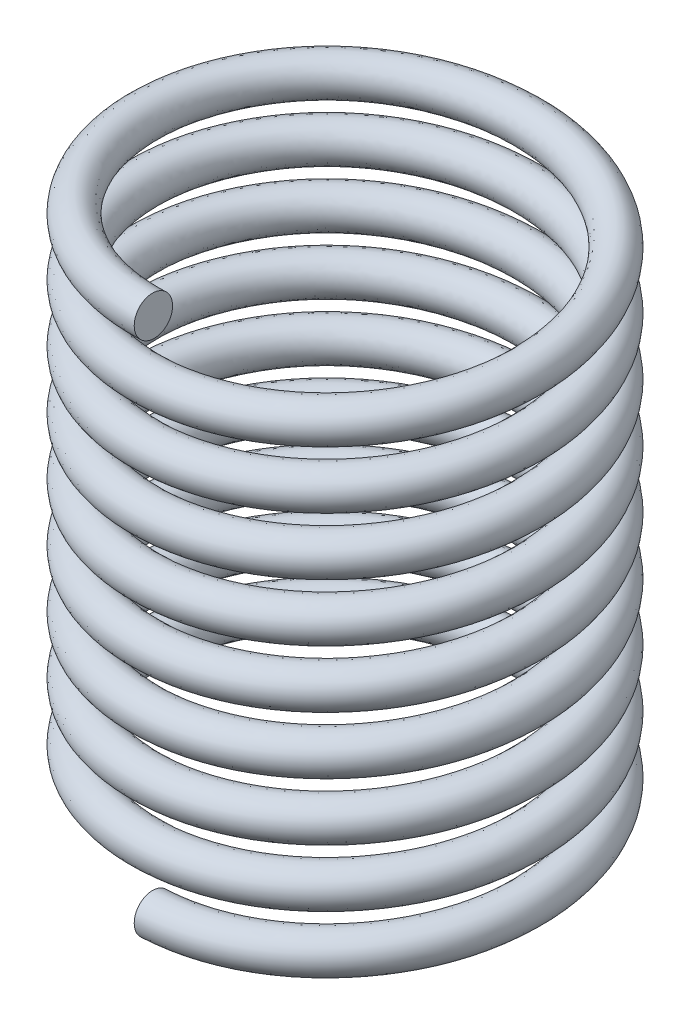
ISO-10303-21;
HEADER;
FILE_DESCRIPTION(('STEP AP214'),'2;1');
FILE_NAME('part.step','',(''),(''),'','','');
FILE_SCHEMA(('AUTOMOTIVE_DESIGN { 1 0 10303 214 1 1 1 1 }'));
ENDSEC;
DATA;
#1=APPLICATION_CONTEXT('core data for automotive mechanical design processes');
#2=APPLICATION_PROTOCOL_DEFINITION('international standard','automotive_design',2000,#1);
#3=PRODUCT_CONTEXT('',#1,'mechanical');
#4=PRODUCT('Part','Part','',(#3));
#5=PRODUCT_RELATED_PRODUCT_CATEGORY('part','',(#4));
#6=PRODUCT_DEFINITION_FORMATION('','',#4);
#7=PRODUCT_DEFINITION_CONTEXT('part definition',#1,'design');
#8=PRODUCT_DEFINITION('design','',#6,#7);
#9=PRODUCT_DEFINITION_SHAPE('','',#8);
#10=(LENGTH_UNIT() NAMED_UNIT(*) SI_UNIT(.MILLI.,.METRE.));
#11=(NAMED_UNIT(*) PLANE_ANGLE_UNIT() SI_UNIT($,.RADIAN.));
#12=(NAMED_UNIT(*) SI_UNIT($,.STERADIAN.) SOLID_ANGLE_UNIT());
#13=UNCERTAINTY_MEASURE_WITH_UNIT(LENGTH_MEASURE(1.E-05),#10,'distance_accuracy_value','');
#14=(GEOMETRIC_REPRESENTATION_CONTEXT(3) GLOBAL_UNCERTAINTY_ASSIGNED_CONTEXT((#13)) GLOBAL_UNIT_ASSIGNED_CONTEXT((#10,
#11,#12)) REPRESENTATION_CONTEXT('',''));
#15=CARTESIAN_POINT('',(0.,0.,0.));
#16=DIRECTION('',(0.,0.,1.));
#17=DIRECTION('',(1.,0.,0.));
#18=AXIS2_PLACEMENT_3D('',#15,#16,#17);
#19=CARTESIAN_POINT('',(-1.24856722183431E-12,-27.,9.99999999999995));
#20=DIRECTION('',(-0.998862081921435,-0.04769215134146,-1.26565858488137E-13));
#21=DIRECTION('',(0.04769215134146,-0.998862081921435,0.));
#22=AXIS2_PLACEMENT_3D('',#19,#20,#21);
#23=PLANE('',#22);
#24=CARTESIAN_POINT('',(-8.12583659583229E-13,-27.,9.99999999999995));
#25=DIRECTION('',(-0.998862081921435,-0.04769215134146,0.));
#26=DIRECTION('',(0.04769215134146,-0.998862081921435,0.));
#27=AXIS2_PLACEMENT_3D('',#24,#25,#26);
#28=CIRCLE('',#27,1.);
#29=CARTESIAN_POINT('',(0.0476921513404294,-27.9988620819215,9.99999999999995));
#30=VERTEX_POINT('',#29);
#31=EDGE_CURVE('E43',#30,#30,#28,.T.);
#32=ORIENTED_EDGE('',*,*,#31,.T.);
#33=EDGE_LOOP('',(#32));
#34=FACE_BOUND('',#33,.T.);
#35=ADVANCED_FACE('F33',(#34),#23,.T.);
#36=CARTESIAN_POINT('',(4.34692429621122E-13,0.,9.99999999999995));
#37=DIRECTION('',(-0.998862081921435,-0.04769215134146,0.));
#38=DIRECTION('',(0.04769215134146,-0.998862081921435,0.));
#39=AXIS2_PLACEMENT_3D('',#36,#37,#38);
#40=PLANE('',#39);
#41=CARTESIAN_POINT('',(4.34692429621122E-13,0.,9.99999999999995));
#42=DIRECTION('',(-0.998862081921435,-0.04769215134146,0.));
#43=DIRECTION('',(0.04769215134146,-0.998862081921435,0.));
#44=AXIS2_PLACEMENT_3D('',#41,#42,#43);
#45=CIRCLE('',#44,1.);
#46=CARTESIAN_POINT('',(0.0476921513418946,-0.998862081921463,9.99999999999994));
#47=VERTEX_POINT('',#46);
#48=EDGE_CURVE('E11',#47,#47,#45,.T.);
#49=ORIENTED_EDGE('',*,*,#48,.F.);
#50=EDGE_LOOP('',(#49));
#51=FACE_BOUND('',#50,.T.);
#52=ADVANCED_FACE('F51',(#51),#40,.F.);
#53=CARTESIAN_POINT('',(0.0476921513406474,-27.9988620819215,9.99999999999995));
#54=CARTESIAN_POINT('',(5.82119484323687,-27.7488620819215,9.97246492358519));
#55=CARTESIAN_POINT('',(8.68410011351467,-27.4988620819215,4.95869738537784));
#56=CARTESIAN_POINT('',(11.5470053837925,-27.2488620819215,-0.0550701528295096));
#57=CARTESIAN_POINT('',(8.63640796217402,-26.9988620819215,-5.0413026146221));
#58=CARTESIAN_POINT('',(5.72581054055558,-26.7488620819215,-10.0275350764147));
#59=CARTESIAN_POINT('',(-0.0476921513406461,-26.4988620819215,-9.99999999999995));
#60=CARTESIAN_POINT('',(-5.82119484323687,-26.2488620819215,-9.97246492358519));
#61=CARTESIAN_POINT('',(-8.68410011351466,-25.9988620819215,-4.95869738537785));
#62=CARTESIAN_POINT('',(-11.5470053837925,-25.7488620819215,0.0550701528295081));
#63=CARTESIAN_POINT('',(-8.63640796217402,-25.4988620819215,5.0413026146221));
#64=CARTESIAN_POINT('',(-5.72581054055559,-25.2488620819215,10.0275350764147));
#65=CARTESIAN_POINT('',(0.0476921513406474,-24.9988620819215,9.99999999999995));
#66=CARTESIAN_POINT('',(5.82119484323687,-24.7488620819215,9.97246492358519));
#67=CARTESIAN_POINT('',(8.68410011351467,-24.4988620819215,4.95869738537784));
#68=CARTESIAN_POINT('',(11.5470053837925,-24.2488620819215,-0.0550701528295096));
#69=CARTESIAN_POINT('',(8.63640796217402,-23.9988620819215,-5.0413026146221));
#70=CARTESIAN_POINT('',(5.72581054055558,-23.7488620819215,-10.0275350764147));
#71=CARTESIAN_POINT('',(-0.0476921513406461,-23.4988620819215,-9.99999999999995));
#72=CARTESIAN_POINT('',(-5.82119484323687,-23.2488620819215,-9.97246492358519));
#73=CARTESIAN_POINT('',(-8.68410011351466,-22.9988620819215,-4.95869738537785));
#74=CARTESIAN_POINT('',(-11.5470053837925,-22.7488620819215,0.0550701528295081));
#75=CARTESIAN_POINT('',(-8.63640796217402,-22.4988620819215,5.0413026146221));
#76=CARTESIAN_POINT('',(-5.72581054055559,-22.2488620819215,10.0275350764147));
#77=CARTESIAN_POINT('',(0.0476921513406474,-21.9988620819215,9.99999999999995));
#78=CARTESIAN_POINT('',(5.82119484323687,-21.7488620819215,9.97246492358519));
#79=CARTESIAN_POINT('',(8.68410011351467,-21.4988620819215,4.95869738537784));
#80=CARTESIAN_POINT('',(11.5470053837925,-21.2488620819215,-0.0550701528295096));
#81=CARTESIAN_POINT('',(8.63640796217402,-20.9988620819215,-5.0413026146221));
#82=CARTESIAN_POINT('',(5.72581054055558,-20.7488620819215,-10.0275350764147));
#83=CARTESIAN_POINT('',(-0.0476921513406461,-20.4988620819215,-9.99999999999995));
#84=CARTESIAN_POINT('',(-5.82119484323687,-20.2488620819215,-9.97246492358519));
#85=CARTESIAN_POINT('',(-8.68410011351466,-19.9988620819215,-4.95869738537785));
#86=CARTESIAN_POINT('',(-11.5470053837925,-19.7488620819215,0.0550701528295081));
#87=CARTESIAN_POINT('',(-8.63640796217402,-19.4988620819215,5.0413026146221));
#88=CARTESIAN_POINT('',(-5.72581054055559,-19.2488620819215,10.0275350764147));
#89=CARTESIAN_POINT('',(0.0476921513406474,-18.9988620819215,9.99999999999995));
#90=CARTESIAN_POINT('',(5.82119484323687,-18.7488620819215,9.97246492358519));
#91=CARTESIAN_POINT('',(8.68410011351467,-18.4988620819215,4.95869738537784));
#92=CARTESIAN_POINT('',(11.5470053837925,-18.2488620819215,-0.0550701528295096));
#93=CARTESIAN_POINT('',(8.63640796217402,-17.9988620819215,-5.0413026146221));
#94=CARTESIAN_POINT('',(5.72581054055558,-17.7488620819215,-10.0275350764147));
#95=CARTESIAN_POINT('',(-0.0476921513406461,-17.4988620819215,-9.99999999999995));
#96=CARTESIAN_POINT('',(-5.82119484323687,-17.2488620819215,-9.97246492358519));
#97=CARTESIAN_POINT('',(-8.68410011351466,-16.9988620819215,-4.95869738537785));
#98=CARTESIAN_POINT('',(-11.5470053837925,-16.7488620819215,0.0550701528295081));
#99=CARTESIAN_POINT('',(-8.63640796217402,-16.4988620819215,5.0413026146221));
#100=CARTESIAN_POINT('',(-5.72581054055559,-16.2488620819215,10.0275350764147));
#101=CARTESIAN_POINT('',(0.0476921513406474,-15.9988620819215,9.99999999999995));
#102=CARTESIAN_POINT('',(5.82119484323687,-15.7488620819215,9.97246492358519));
#103=CARTESIAN_POINT('',(8.68410011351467,-15.4988620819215,4.95869738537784));
#104=CARTESIAN_POINT('',(11.5470053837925,-15.2488620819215,-0.0550701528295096));
#105=CARTESIAN_POINT('',(8.63640796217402,-14.9988620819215,-5.0413026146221));
#106=CARTESIAN_POINT('',(5.72581054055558,-14.7488620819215,-10.0275350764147));
#107=CARTESIAN_POINT('',(-0.0476921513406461,-14.4988620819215,-9.99999999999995));
#108=CARTESIAN_POINT('',(-5.82119484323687,-14.2488620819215,-9.97246492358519));
#109=CARTESIAN_POINT('',(-8.68410011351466,-13.9988620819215,-4.95869738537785));
#110=CARTESIAN_POINT('',(-11.5470053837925,-13.7488620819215,0.0550701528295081));
#111=CARTESIAN_POINT('',(-8.63640796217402,-13.4988620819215,5.0413026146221));
#112=CARTESIAN_POINT('',(-5.72581054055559,-13.2488620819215,10.0275350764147));
#113=CARTESIAN_POINT('',(0.0476921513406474,-12.9988620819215,9.99999999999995));
#114=CARTESIAN_POINT('',(5.82119484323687,-12.7488620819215,9.97246492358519));
#115=CARTESIAN_POINT('',(8.68410011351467,-12.4988620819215,4.95869738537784));
#116=CARTESIAN_POINT('',(11.5470053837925,-12.2488620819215,-0.0550701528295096));
#117=CARTESIAN_POINT('',(8.63640796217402,-11.9988620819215,-5.0413026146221));
#118=CARTESIAN_POINT('',(5.72581054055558,-11.7488620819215,-10.0275350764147));
#119=CARTESIAN_POINT('',(-0.0476921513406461,-11.4988620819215,-9.99999999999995));
#120=CARTESIAN_POINT('',(-5.82119484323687,-11.2488620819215,-9.97246492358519));
#121=CARTESIAN_POINT('',(-8.68410011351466,-10.9988620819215,-4.95869738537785));
#122=CARTESIAN_POINT('',(-11.5470053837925,-10.7488620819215,0.0550701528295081));
#123=CARTESIAN_POINT('',(-8.63640796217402,-10.4988620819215,5.0413026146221));
#124=CARTESIAN_POINT('',(-5.72581054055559,-10.2488620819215,10.0275350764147));
#125=CARTESIAN_POINT('',(0.0476921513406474,-9.99886208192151,9.99999999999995));
#126=CARTESIAN_POINT('',(5.82119484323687,-9.74886208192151,9.97246492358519));
#127=CARTESIAN_POINT('',(8.68410011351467,-9.49886208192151,4.95869738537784));
#128=CARTESIAN_POINT('',(11.5470053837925,-9.24886208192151,-0.0550701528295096));
#129=CARTESIAN_POINT('',(8.63640796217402,-8.99886208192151,-5.0413026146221));
#130=CARTESIAN_POINT('',(5.72581054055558,-8.74886208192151,-10.0275350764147));
#131=CARTESIAN_POINT('',(-0.0476921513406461,-8.49886208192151,-9.99999999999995));
#132=CARTESIAN_POINT('',(-5.82119484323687,-8.24886208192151,-9.97246492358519));
#133=CARTESIAN_POINT('',(-8.68410011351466,-7.99886208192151,-4.95869738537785));
#134=CARTESIAN_POINT('',(-11.5470053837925,-7.74886208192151,0.0550701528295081));
#135=CARTESIAN_POINT('',(-8.63640796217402,-7.49886208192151,5.0413026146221));
#136=CARTESIAN_POINT('',(-5.72581054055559,-7.24886208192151,10.0275350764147));
#137=CARTESIAN_POINT('',(0.0476921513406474,-6.99886208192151,9.99999999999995));
#138=CARTESIAN_POINT('',(5.82119484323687,-6.74886208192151,9.97246492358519));
#139=CARTESIAN_POINT('',(8.68410011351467,-6.49886208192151,4.95869738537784));
#140=CARTESIAN_POINT('',(11.5470053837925,-6.24886208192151,-0.0550701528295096));
#141=CARTESIAN_POINT('',(8.63640796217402,-5.99886208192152,-5.0413026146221));
#142=CARTESIAN_POINT('',(5.72581054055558,-5.74886208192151,-10.0275350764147));
#143=CARTESIAN_POINT('',(-0.0476921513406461,-5.49886208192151,-9.99999999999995));
#144=CARTESIAN_POINT('',(-5.82119484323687,-5.24886208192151,-9.97246492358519));
#145=CARTESIAN_POINT('',(-8.68410011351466,-4.99886208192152,-4.95869738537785));
#146=CARTESIAN_POINT('',(-11.5470053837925,-4.74886208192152,0.0550701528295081));
#147=CARTESIAN_POINT('',(-8.63640796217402,-4.49886208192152,5.0413026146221));
#148=CARTESIAN_POINT('',(-5.72581054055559,-4.24886208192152,10.0275350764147));
#149=CARTESIAN_POINT('',(0.0476921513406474,-3.99886208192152,9.99999999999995));
#150=CARTESIAN_POINT('',(5.82119484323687,-3.74886208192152,9.97246492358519));
#151=CARTESIAN_POINT('',(8.68410011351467,-3.49886208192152,4.95869738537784));
#152=CARTESIAN_POINT('',(11.5470053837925,-3.24886208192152,-0.0550701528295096));
#153=CARTESIAN_POINT('',(8.63640796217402,-2.99886208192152,-5.0413026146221));
#154=CARTESIAN_POINT('',(5.72581054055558,-2.74886208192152,-10.0275350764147));
#155=CARTESIAN_POINT('',(-0.0476921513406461,-2.49886208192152,-9.99999999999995));
#156=CARTESIAN_POINT('',(-5.82119484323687,-2.24886208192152,-9.97246492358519));
#157=CARTESIAN_POINT('',(-8.68410011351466,-1.99886208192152,-4.95869738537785));
#158=CARTESIAN_POINT('',(-11.5470053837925,-1.74886208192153,0.0550701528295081));
#159=CARTESIAN_POINT('',(-8.63640796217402,-1.49886208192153,5.0413026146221));
#160=CARTESIAN_POINT('',(-5.72581054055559,-1.24886208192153,10.0275350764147));
#161=CARTESIAN_POINT('',(0.0476921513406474,-0.998862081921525,9.99999999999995));
#162=CARTESIAN_POINT('',(5.82119484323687,-0.748862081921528,9.97246492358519));
#163=CARTESIAN_POINT('',(8.68410011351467,-0.498862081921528,4.95869738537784));
#164=CARTESIAN_POINT('',(11.5470053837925,-0.248862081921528,-0.0550701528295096));
#165=CARTESIAN_POINT('',(8.63640796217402,0.00113791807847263,-5.0413026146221));
#166=CARTESIAN_POINT('',(5.72581054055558,0.251137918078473,-10.0275350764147));
#167=CARTESIAN_POINT('',(-0.0476921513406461,0.50113791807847,-9.99999999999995));
#168=CARTESIAN_POINT('',(-5.82119484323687,0.75113791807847,-9.97246492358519));
#169=CARTESIAN_POINT('',(-8.68410011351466,1.00113791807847,-4.95869738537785));
#170=CARTESIAN_POINT('',(-11.5470053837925,1.25113791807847,0.0550701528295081));
#171=CARTESIAN_POINT('',(-8.63640796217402,1.50113791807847,5.0413026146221));
#172=CARTESIAN_POINT('',(-5.72581054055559,1.75113791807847,10.0275350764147));
#173=CARTESIAN_POINT('',(0.0476921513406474,2.00113791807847,9.99999999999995));
#174=CARTESIAN_POINT('',(0.0476921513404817,-27.9988620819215,12.));
#175=CARTESIAN_POINT('',(6.97589538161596,-27.7488620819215,11.9724649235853));
#176=CARTESIAN_POINT('',(10.4161509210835,-27.4988620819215,5.95869738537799));
#177=CARTESIAN_POINT('',(13.856406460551,-27.2488620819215,-0.0550701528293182));
#178=CARTESIAN_POINT('',(10.368458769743,-26.9988620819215,-6.04130261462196));
#179=CARTESIAN_POINT('',(6.880511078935,-26.7488620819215,-12.0275350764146));
#180=CARTESIAN_POINT('',(-0.0476921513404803,-26.4988620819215,-12.));
#181=CARTESIAN_POINT('',(-6.97589538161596,-26.2488620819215,-11.9724649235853));
#182=CARTESIAN_POINT('',(-10.4161509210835,-25.9988620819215,-5.95869738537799));
#183=CARTESIAN_POINT('',(-13.856406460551,-25.7488620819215,0.0550701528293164));
#184=CARTESIAN_POINT('',(-10.368458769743,-25.4988620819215,6.04130261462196));
#185=CARTESIAN_POINT('',(-6.880511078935,-25.2488620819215,12.0275350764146));
#186=CARTESIAN_POINT('',(0.0476921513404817,-24.9988620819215,12.));
#187=CARTESIAN_POINT('',(6.97589538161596,-24.7488620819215,11.9724649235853));
#188=CARTESIAN_POINT('',(10.4161509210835,-24.4988620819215,5.95869738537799));
#189=CARTESIAN_POINT('',(13.856406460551,-24.2488620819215,-0.0550701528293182));
#190=CARTESIAN_POINT('',(10.368458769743,-23.9988620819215,-6.04130261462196));
#191=CARTESIAN_POINT('',(6.880511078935,-23.7488620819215,-12.0275350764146));
#192=CARTESIAN_POINT('',(-0.0476921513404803,-23.4988620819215,-12.));
#193=CARTESIAN_POINT('',(-6.97589538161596,-23.2488620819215,-11.9724649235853));
#194=CARTESIAN_POINT('',(-10.4161509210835,-22.9988620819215,-5.95869738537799));
#195=CARTESIAN_POINT('',(-13.856406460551,-22.7488620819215,0.0550701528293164));
#196=CARTESIAN_POINT('',(-10.368458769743,-22.4988620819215,6.04130261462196));
#197=CARTESIAN_POINT('',(-6.880511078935,-22.2488620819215,12.0275350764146));
#198=CARTESIAN_POINT('',(0.0476921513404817,-21.9988620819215,12.));
#199=CARTESIAN_POINT('',(6.97589538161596,-21.7488620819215,11.9724649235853));
#200=CARTESIAN_POINT('',(10.4161509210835,-21.4988620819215,5.95869738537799));
#201=CARTESIAN_POINT('',(13.856406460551,-21.2488620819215,-0.0550701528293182));
#202=CARTESIAN_POINT('',(10.368458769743,-20.9988620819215,-6.04130261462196));
#203=CARTESIAN_POINT('',(6.880511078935,-20.7488620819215,-12.0275350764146));
#204=CARTESIAN_POINT('',(-0.0476921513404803,-20.4988620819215,-12.));
#205=CARTESIAN_POINT('',(-6.97589538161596,-20.2488620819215,-11.9724649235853));
#206=CARTESIAN_POINT('',(-10.4161509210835,-19.9988620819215,-5.95869738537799));
#207=CARTESIAN_POINT('',(-13.856406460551,-19.7488620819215,0.0550701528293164));
#208=CARTESIAN_POINT('',(-10.368458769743,-19.4988620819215,6.04130261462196));
#209=CARTESIAN_POINT('',(-6.880511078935,-19.2488620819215,12.0275350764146));
#210=CARTESIAN_POINT('',(0.0476921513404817,-18.9988620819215,12.));
#211=CARTESIAN_POINT('',(6.97589538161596,-18.7488620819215,11.9724649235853));
#212=CARTESIAN_POINT('',(10.4161509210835,-18.4988620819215,5.95869738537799));
#213=CARTESIAN_POINT('',(13.856406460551,-18.2488620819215,-0.0550701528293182));
#214=CARTESIAN_POINT('',(10.368458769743,-17.9988620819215,-6.04130261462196));
#215=CARTESIAN_POINT('',(6.880511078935,-17.7488620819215,-12.0275350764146));
#216=CARTESIAN_POINT('',(-0.0476921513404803,-17.4988620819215,-12.));
#217=CARTESIAN_POINT('',(-6.97589538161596,-17.2488620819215,-11.9724649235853));
#218=CARTESIAN_POINT('',(-10.4161509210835,-16.9988620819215,-5.95869738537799));
#219=CARTESIAN_POINT('',(-13.856406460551,-16.7488620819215,0.0550701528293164));
#220=CARTESIAN_POINT('',(-10.368458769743,-16.4988620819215,6.04130261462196));
#221=CARTESIAN_POINT('',(-6.880511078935,-16.2488620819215,12.0275350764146));
#222=CARTESIAN_POINT('',(0.0476921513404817,-15.9988620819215,12.));
#223=CARTESIAN_POINT('',(6.97589538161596,-15.7488620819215,11.9724649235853));
#224=CARTESIAN_POINT('',(10.4161509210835,-15.4988620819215,5.95869738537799));
#225=CARTESIAN_POINT('',(13.856406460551,-15.2488620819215,-0.0550701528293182));
#226=CARTESIAN_POINT('',(10.368458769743,-14.9988620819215,-6.04130261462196));
#227=CARTESIAN_POINT('',(6.880511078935,-14.7488620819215,-12.0275350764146));
#228=CARTESIAN_POINT('',(-0.0476921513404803,-14.4988620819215,-12.));
#229=CARTESIAN_POINT('',(-6.97589538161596,-14.2488620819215,-11.9724649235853));
#230=CARTESIAN_POINT('',(-10.4161509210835,-13.9988620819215,-5.95869738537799));
#231=CARTESIAN_POINT('',(-13.856406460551,-13.7488620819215,0.0550701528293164));
#232=CARTESIAN_POINT('',(-10.368458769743,-13.4988620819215,6.04130261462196));
#233=CARTESIAN_POINT('',(-6.880511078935,-13.2488620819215,12.0275350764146));
#234=CARTESIAN_POINT('',(0.0476921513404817,-12.9988620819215,12.));
#235=CARTESIAN_POINT('',(6.97589538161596,-12.7488620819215,11.9724649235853));
#236=CARTESIAN_POINT('',(10.4161509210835,-12.4988620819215,5.95869738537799));
#237=CARTESIAN_POINT('',(13.856406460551,-12.2488620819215,-0.0550701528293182));
#238=CARTESIAN_POINT('',(10.368458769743,-11.9988620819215,-6.04130261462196));
#239=CARTESIAN_POINT('',(6.880511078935,-11.7488620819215,-12.0275350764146));
#240=CARTESIAN_POINT('',(-0.0476921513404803,-11.4988620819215,-12.));
#241=CARTESIAN_POINT('',(-6.97589538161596,-11.2488620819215,-11.9724649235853));
#242=CARTESIAN_POINT('',(-10.4161509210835,-10.9988620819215,-5.95869738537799));
#243=CARTESIAN_POINT('',(-13.856406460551,-10.7488620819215,0.0550701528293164));
#244=CARTESIAN_POINT('',(-10.368458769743,-10.4988620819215,6.04130261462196));
#245=CARTESIAN_POINT('',(-6.880511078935,-10.2488620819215,12.0275350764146));
#246=CARTESIAN_POINT('',(0.0476921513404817,-9.99886208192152,12.));
#247=CARTESIAN_POINT('',(6.97589538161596,-9.74886208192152,11.9724649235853));
#248=CARTESIAN_POINT('',(10.4161509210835,-9.49886208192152,5.95869738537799));
#249=CARTESIAN_POINT('',(13.856406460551,-9.24886208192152,-0.0550701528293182));
#250=CARTESIAN_POINT('',(10.368458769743,-8.99886208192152,-6.04130261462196));
#251=CARTESIAN_POINT('',(6.880511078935,-8.74886208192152,-12.0275350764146));
#252=CARTESIAN_POINT('',(-0.0476921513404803,-8.49886208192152,-12.));
#253=CARTESIAN_POINT('',(-6.97589538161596,-8.24886208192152,-11.9724649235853));
#254=CARTESIAN_POINT('',(-10.4161509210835,-7.99886208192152,-5.95869738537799));
#255=CARTESIAN_POINT('',(-13.856406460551,-7.74886208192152,0.0550701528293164));
#256=CARTESIAN_POINT('',(-10.368458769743,-7.49886208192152,6.04130261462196));
#257=CARTESIAN_POINT('',(-6.880511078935,-7.24886208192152,12.0275350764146));
#258=CARTESIAN_POINT('',(0.0476921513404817,-6.99886208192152,12.));
#259=CARTESIAN_POINT('',(6.97589538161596,-6.74886208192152,11.9724649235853));
#260=CARTESIAN_POINT('',(10.4161509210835,-6.49886208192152,5.95869738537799));
#261=CARTESIAN_POINT('',(13.856406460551,-6.24886208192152,-0.0550701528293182));
#262=CARTESIAN_POINT('',(10.368458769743,-5.99886208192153,-6.04130261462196));
#263=CARTESIAN_POINT('',(6.880511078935,-5.74886208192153,-12.0275350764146));
#264=CARTESIAN_POINT('',(-0.0476921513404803,-5.49886208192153,-12.));
#265=CARTESIAN_POINT('',(-6.97589538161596,-5.24886208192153,-11.9724649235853));
#266=CARTESIAN_POINT('',(-10.4161509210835,-4.99886208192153,-5.95869738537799));
#267=CARTESIAN_POINT('',(-13.856406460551,-4.74886208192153,0.0550701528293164));
#268=CARTESIAN_POINT('',(-10.368458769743,-4.49886208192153,6.04130261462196));
#269=CARTESIAN_POINT('',(-6.880511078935,-4.24886208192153,12.0275350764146));
#270=CARTESIAN_POINT('',(0.0476921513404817,-3.99886208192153,12.));
#271=CARTESIAN_POINT('',(6.97589538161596,-3.74886208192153,11.9724649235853));
#272=CARTESIAN_POINT('',(10.4161509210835,-3.49886208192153,5.95869738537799));
#273=CARTESIAN_POINT('',(13.856406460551,-3.24886208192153,-0.0550701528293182));
#274=CARTESIAN_POINT('',(10.368458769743,-2.99886208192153,-6.04130261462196));
#275=CARTESIAN_POINT('',(6.880511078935,-2.74886208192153,-12.0275350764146));
#276=CARTESIAN_POINT('',(-0.0476921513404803,-2.49886208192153,-12.));
#277=CARTESIAN_POINT('',(-6.97589538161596,-2.24886208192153,-11.9724649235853));
#278=CARTESIAN_POINT('',(-10.4161509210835,-1.99886208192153,-5.95869738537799));
#279=CARTESIAN_POINT('',(-13.856406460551,-1.74886208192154,0.0550701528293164));
#280=CARTESIAN_POINT('',(-10.368458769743,-1.49886208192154,6.04130261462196));
#281=CARTESIAN_POINT('',(-6.880511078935,-1.24886208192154,12.0275350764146));
#282=CARTESIAN_POINT('',(0.0476921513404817,-0.998862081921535,12.));
#283=CARTESIAN_POINT('',(6.97589538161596,-0.748862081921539,11.9724649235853));
#284=CARTESIAN_POINT('',(10.4161509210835,-0.498862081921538,5.95869738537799));
#285=CARTESIAN_POINT('',(13.856406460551,-0.248862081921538,-0.0550701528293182));
#286=CARTESIAN_POINT('',(10.368458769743,0.00113791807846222,-6.04130261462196));
#287=CARTESIAN_POINT('',(6.880511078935,0.251137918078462,-12.0275350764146));
#288=CARTESIAN_POINT('',(-0.0476921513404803,0.501137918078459,-12.));
#289=CARTESIAN_POINT('',(-6.97589538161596,0.751137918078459,-11.9724649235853));
#290=CARTESIAN_POINT('',(-10.4161509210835,1.00113791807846,-5.95869738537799));
#291=CARTESIAN_POINT('',(-13.856406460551,1.25113791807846,0.0550701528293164));
#292=CARTESIAN_POINT('',(-10.368458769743,1.50113791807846,6.04130261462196));
#293=CARTESIAN_POINT('',(-6.880511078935,1.75113791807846,12.0275350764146));
#294=CARTESIAN_POINT('',(0.0476921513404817,2.00113791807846,12.));
#295=CARTESIAN_POINT('',(-0.0476921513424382,-26.0011379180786,12.));
#296=CARTESIAN_POINT('',(6.88051107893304,-25.7511379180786,12.0275350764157));
#297=CARTESIAN_POINT('',(10.368458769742,-25.5011379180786,6.04130261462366));
#298=CARTESIAN_POINT('',(13.856406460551,-25.2511379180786,0.0550701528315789));
#299=CARTESIAN_POINT('',(10.4161509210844,-25.0011379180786,-5.95869738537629));
#300=CARTESIAN_POINT('',(6.97589538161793,-24.7511379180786,-11.9724649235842));
#301=CARTESIAN_POINT('',(0.0476921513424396,-24.5011379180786,-12.));
#302=CARTESIAN_POINT('',(-6.88051107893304,-24.2511379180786,-12.0275350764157));
#303=CARTESIAN_POINT('',(-10.368458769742,-24.0011379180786,-6.04130261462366));
#304=CARTESIAN_POINT('',(-13.856406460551,-23.7511379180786,-0.0550701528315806));
#305=CARTESIAN_POINT('',(-10.4161509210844,-23.5011379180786,5.95869738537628));
#306=CARTESIAN_POINT('',(-6.97589538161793,-23.2511379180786,11.9724649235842));
#307=CARTESIAN_POINT('',(-0.0476921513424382,-23.0011379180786,12.));
#308=CARTESIAN_POINT('',(6.88051107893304,-22.7511379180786,12.0275350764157));
#309=CARTESIAN_POINT('',(10.368458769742,-22.5011379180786,6.04130261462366));
#310=CARTESIAN_POINT('',(13.856406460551,-22.2511379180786,0.0550701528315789));
#311=CARTESIAN_POINT('',(10.4161509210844,-22.0011379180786,-5.95869738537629));
#312=CARTESIAN_POINT('',(6.97589538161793,-21.7511379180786,-11.9724649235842));
#313=CARTESIAN_POINT('',(0.0476921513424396,-21.5011379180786,-12.));
#314=CARTESIAN_POINT('',(-6.88051107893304,-21.2511379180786,-12.0275350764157));
#315=CARTESIAN_POINT('',(-10.368458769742,-21.0011379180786,-6.04130261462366));
#316=CARTESIAN_POINT('',(-13.856406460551,-20.7511379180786,-0.0550701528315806));
#317=CARTESIAN_POINT('',(-10.4161509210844,-20.5011379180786,5.95869738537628));
#318=CARTESIAN_POINT('',(-6.97589538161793,-20.2511379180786,11.9724649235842));
#319=CARTESIAN_POINT('',(-0.0476921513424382,-20.0011379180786,12.));
#320=CARTESIAN_POINT('',(6.88051107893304,-19.7511379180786,12.0275350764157));
#321=CARTESIAN_POINT('',(10.368458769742,-19.5011379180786,6.04130261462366));
#322=CARTESIAN_POINT('',(13.856406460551,-19.2511379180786,0.0550701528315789));
#323=CARTESIAN_POINT('',(10.4161509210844,-19.0011379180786,-5.95869738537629));
#324=CARTESIAN_POINT('',(6.97589538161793,-18.7511379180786,-11.9724649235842));
#325=CARTESIAN_POINT('',(0.0476921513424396,-18.5011379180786,-12.));
#326=CARTESIAN_POINT('',(-6.88051107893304,-18.2511379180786,-12.0275350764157));
#327=CARTESIAN_POINT('',(-10.368458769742,-18.0011379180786,-6.04130261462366));
#328=CARTESIAN_POINT('',(-13.856406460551,-17.7511379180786,-0.0550701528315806));
#329=CARTESIAN_POINT('',(-10.4161509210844,-17.5011379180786,5.95869738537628));
#330=CARTESIAN_POINT('',(-6.97589538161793,-17.2511379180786,11.9724649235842));
#331=CARTESIAN_POINT('',(-0.0476921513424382,-17.0011379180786,12.));
#332=CARTESIAN_POINT('',(6.88051107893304,-16.7511379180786,12.0275350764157));
#333=CARTESIAN_POINT('',(10.368458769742,-16.5011379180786,6.04130261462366));
#334=CARTESIAN_POINT('',(13.856406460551,-16.2511379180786,0.0550701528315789));
#335=CARTESIAN_POINT('',(10.4161509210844,-16.0011379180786,-5.95869738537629));
#336=CARTESIAN_POINT('',(6.97589538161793,-15.7511379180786,-11.9724649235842));
#337=CARTESIAN_POINT('',(0.0476921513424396,-15.5011379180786,-12.));
#338=CARTESIAN_POINT('',(-6.88051107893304,-15.2511379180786,-12.0275350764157));
#339=CARTESIAN_POINT('',(-10.368458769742,-15.0011379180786,-6.04130261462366));
#340=CARTESIAN_POINT('',(-13.856406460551,-14.7511379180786,-0.0550701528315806));
#341=CARTESIAN_POINT('',(-10.4161509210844,-14.5011379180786,5.95869738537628));
#342=CARTESIAN_POINT('',(-6.97589538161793,-14.2511379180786,11.9724649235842));
#343=CARTESIAN_POINT('',(-0.0476921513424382,-14.0011379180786,12.));
#344=CARTESIAN_POINT('',(6.88051107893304,-13.7511379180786,12.0275350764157));
#345=CARTESIAN_POINT('',(10.368458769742,-13.5011379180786,6.04130261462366));
#346=CARTESIAN_POINT('',(13.856406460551,-13.2511379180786,0.0550701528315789));
#347=CARTESIAN_POINT('',(10.4161509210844,-13.0011379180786,-5.95869738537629));
#348=CARTESIAN_POINT('',(6.97589538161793,-12.7511379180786,-11.9724649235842));
#349=CARTESIAN_POINT('',(0.0476921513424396,-12.5011379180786,-12.));
#350=CARTESIAN_POINT('',(-6.88051107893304,-12.2511379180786,-12.0275350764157));
#351=CARTESIAN_POINT('',(-10.368458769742,-12.0011379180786,-6.04130261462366));
#352=CARTESIAN_POINT('',(-13.856406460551,-11.7511379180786,-0.0550701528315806));
#353=CARTESIAN_POINT('',(-10.4161509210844,-11.5011379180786,5.95869738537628));
#354=CARTESIAN_POINT('',(-6.97589538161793,-11.2511379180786,11.9724649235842));
#355=CARTESIAN_POINT('',(-0.0476921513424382,-11.0011379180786,12.));
#356=CARTESIAN_POINT('',(6.88051107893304,-10.7511379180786,12.0275350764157));
#357=CARTESIAN_POINT('',(10.368458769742,-10.5011379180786,6.04130261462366));
#358=CARTESIAN_POINT('',(13.856406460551,-10.2511379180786,0.0550701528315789));
#359=CARTESIAN_POINT('',(10.4161509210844,-10.0011379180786,-5.95869738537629));
#360=CARTESIAN_POINT('',(6.97589538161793,-9.75113791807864,-11.9724649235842));
#361=CARTESIAN_POINT('',(0.0476921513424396,-9.50113791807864,-12.));
#362=CARTESIAN_POINT('',(-6.88051107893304,-9.25113791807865,-12.0275350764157));
#363=CARTESIAN_POINT('',(-10.368458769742,-9.00113791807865,-6.04130261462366));
#364=CARTESIAN_POINT('',(-13.856406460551,-8.75113791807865,-0.0550701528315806));
#365=CARTESIAN_POINT('',(-10.4161509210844,-8.50113791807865,5.95869738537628));
#366=CARTESIAN_POINT('',(-6.97589538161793,-8.25113791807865,11.9724649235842));
#367=CARTESIAN_POINT('',(-0.0476921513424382,-8.00113791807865,12.));
#368=CARTESIAN_POINT('',(6.88051107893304,-7.75113791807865,12.0275350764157));
#369=CARTESIAN_POINT('',(10.368458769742,-7.50113791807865,6.04130261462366));
#370=CARTESIAN_POINT('',(13.856406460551,-7.25113791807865,0.0550701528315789));
#371=CARTESIAN_POINT('',(10.4161509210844,-7.00113791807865,-5.95869738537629));
#372=CARTESIAN_POINT('',(6.97589538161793,-6.75113791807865,-11.9724649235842));
#373=CARTESIAN_POINT('',(0.0476921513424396,-6.50113791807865,-12.));
#374=CARTESIAN_POINT('',(-6.88051107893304,-6.25113791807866,-12.0275350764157));
#375=CARTESIAN_POINT('',(-10.368458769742,-6.00113791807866,-6.04130261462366));
#376=CARTESIAN_POINT('',(-13.856406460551,-5.75113791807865,-0.0550701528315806));
#377=CARTESIAN_POINT('',(-10.4161509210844,-5.50113791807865,5.95869738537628));
#378=CARTESIAN_POINT('',(-6.97589538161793,-5.25113791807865,11.9724649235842));
#379=CARTESIAN_POINT('',(-0.0476921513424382,-5.00113791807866,12.));
#380=CARTESIAN_POINT('',(6.88051107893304,-4.75113791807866,12.0275350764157));
#381=CARTESIAN_POINT('',(10.368458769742,-4.50113791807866,6.04130261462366));
#382=CARTESIAN_POINT('',(13.856406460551,-4.25113791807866,0.0550701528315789));
#383=CARTESIAN_POINT('',(10.4161509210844,-4.00113791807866,-5.95869738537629));
#384=CARTESIAN_POINT('',(6.97589538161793,-3.75113791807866,-11.9724649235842));
#385=CARTESIAN_POINT('',(0.0476921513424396,-3.50113791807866,-12.));
#386=CARTESIAN_POINT('',(-6.88051107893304,-3.25113791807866,-12.0275350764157));
#387=CARTESIAN_POINT('',(-10.368458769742,-3.00113791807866,-6.04130261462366));
#388=CARTESIAN_POINT('',(-13.856406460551,-2.75113791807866,-0.0550701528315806));
#389=CARTESIAN_POINT('',(-10.4161509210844,-2.50113791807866,5.95869738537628));
#390=CARTESIAN_POINT('',(-6.97589538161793,-2.25113791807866,11.9724649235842));
#391=CARTESIAN_POINT('',(-0.0476921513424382,-2.00113791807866,12.));
#392=CARTESIAN_POINT('',(6.88051107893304,-1.75113791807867,12.0275350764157));
#393=CARTESIAN_POINT('',(10.368458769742,-1.50113791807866,6.04130261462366));
#394=CARTESIAN_POINT('',(13.856406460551,-1.25113791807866,0.0550701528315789));
#395=CARTESIAN_POINT('',(10.4161509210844,-1.00113791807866,-5.95869738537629));
#396=CARTESIAN_POINT('',(6.97589538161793,-0.751137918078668,-11.9724649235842));
#397=CARTESIAN_POINT('',(0.0476921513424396,-0.501137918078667,-12.));
#398=CARTESIAN_POINT('',(-6.88051107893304,-0.251137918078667,-12.0275350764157));
#399=CARTESIAN_POINT('',(-10.368458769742,-0.00113791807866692,-6.04130261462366));
#400=CARTESIAN_POINT('',(-13.856406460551,0.24886208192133,-0.0550701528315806));
#401=CARTESIAN_POINT('',(-10.4161509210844,0.49886208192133,5.95869738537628));
#402=CARTESIAN_POINT('',(-6.97589538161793,0.74886208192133,11.9724649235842));
#403=CARTESIAN_POINT('',(-0.0476921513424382,0.998862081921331,12.));
#404=CARTESIAN_POINT('',(6.88051107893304,1.24886208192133,12.0275350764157));
#405=CARTESIAN_POINT('',(10.368458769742,1.49886208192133,6.04130261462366));
#406=CARTESIAN_POINT('',(13.856406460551,1.74886208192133,0.0550701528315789));
#407=CARTESIAN_POINT('',(10.4161509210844,1.99886208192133,-5.95869738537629));
#408=CARTESIAN_POINT('',(6.97589538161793,2.24886208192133,-11.9724649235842));
#409=CARTESIAN_POINT('',(0.0476921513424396,2.49886208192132,-12.));
#410=CARTESIAN_POINT('',(-6.88051107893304,2.74886208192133,-12.0275350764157));
#411=CARTESIAN_POINT('',(-10.368458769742,2.99886208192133,-6.04130261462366));
#412=CARTESIAN_POINT('',(-13.856406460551,3.24886208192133,-0.0550701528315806));
#413=CARTESIAN_POINT('',(-10.4161509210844,3.49886208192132,5.95869738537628));
#414=CARTESIAN_POINT('',(-6.97589538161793,3.74886208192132,11.9724649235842));
#415=CARTESIAN_POINT('',(-0.0476921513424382,3.99886208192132,12.));
#416=CARTESIAN_POINT('',(-0.0476921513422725,-26.0011379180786,9.99999999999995));
#417=CARTESIAN_POINT('',(5.72581054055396,-25.7511379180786,10.0275350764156));
#418=CARTESIAN_POINT('',(8.63640796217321,-25.5011379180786,5.04130261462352));
#419=CARTESIAN_POINT('',(11.5470053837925,-25.2511379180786,0.0550701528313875));
#420=CARTESIAN_POINT('',(8.68410011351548,-25.0011379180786,-4.95869738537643));
#421=CARTESIAN_POINT('',(5.82119484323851,-24.7511379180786,-9.97246492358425));
#422=CARTESIAN_POINT('',(0.0476921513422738,-24.5011379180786,-9.99999999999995));
#423=CARTESIAN_POINT('',(-5.72581054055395,-24.2511379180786,-10.0275350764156));
#424=CARTESIAN_POINT('',(-8.63640796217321,-24.0011379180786,-5.04130261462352));
#425=CARTESIAN_POINT('',(-11.5470053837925,-23.7511379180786,-0.055070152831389));
#426=CARTESIAN_POINT('',(-8.68410011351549,-23.5011379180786,4.95869738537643));
#427=CARTESIAN_POINT('',(-5.82119484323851,-23.2511379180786,9.97246492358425));
#428=CARTESIAN_POINT('',(-0.0476921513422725,-23.0011379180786,9.99999999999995));
#429=CARTESIAN_POINT('',(5.72581054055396,-22.7511379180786,10.0275350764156));
#430=CARTESIAN_POINT('',(8.63640796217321,-22.5011379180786,5.04130261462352));
#431=CARTESIAN_POINT('',(11.5470053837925,-22.2511379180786,0.0550701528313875));
#432=CARTESIAN_POINT('',(8.68410011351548,-22.0011379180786,-4.95869738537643));
#433=CARTESIAN_POINT('',(5.82119484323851,-21.7511379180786,-9.97246492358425));
#434=CARTESIAN_POINT('',(0.0476921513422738,-21.5011379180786,-9.99999999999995));
#435=CARTESIAN_POINT('',(-5.72581054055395,-21.2511379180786,-10.0275350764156));
#436=CARTESIAN_POINT('',(-8.63640796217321,-21.0011379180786,-5.04130261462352));
#437=CARTESIAN_POINT('',(-11.5470053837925,-20.7511379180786,-0.055070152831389));
#438=CARTESIAN_POINT('',(-8.68410011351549,-20.5011379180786,4.95869738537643));
#439=CARTESIAN_POINT('',(-5.82119484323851,-20.2511379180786,9.97246492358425));
#440=CARTESIAN_POINT('',(-0.0476921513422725,-20.0011379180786,9.99999999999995));
#441=CARTESIAN_POINT('',(5.72581054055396,-19.7511379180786,10.0275350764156));
#442=CARTESIAN_POINT('',(8.63640796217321,-19.5011379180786,5.04130261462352));
#443=CARTESIAN_POINT('',(11.5470053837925,-19.2511379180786,0.0550701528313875));
#444=CARTESIAN_POINT('',(8.68410011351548,-19.0011379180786,-4.95869738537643));
#445=CARTESIAN_POINT('',(5.82119484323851,-18.7511379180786,-9.97246492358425));
#446=CARTESIAN_POINT('',(0.0476921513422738,-18.5011379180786,-9.99999999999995));
#447=CARTESIAN_POINT('',(-5.72581054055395,-18.2511379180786,-10.0275350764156));
#448=CARTESIAN_POINT('',(-8.63640796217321,-18.0011379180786,-5.04130261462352));
#449=CARTESIAN_POINT('',(-11.5470053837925,-17.7511379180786,-0.055070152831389));
#450=CARTESIAN_POINT('',(-8.68410011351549,-17.5011379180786,4.95869738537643));
#451=CARTESIAN_POINT('',(-5.82119484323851,-17.2511379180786,9.97246492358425));
#452=CARTESIAN_POINT('',(-0.0476921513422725,-17.0011379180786,9.99999999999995));
#453=CARTESIAN_POINT('',(5.72581054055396,-16.7511379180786,10.0275350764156));
#454=CARTESIAN_POINT('',(8.63640796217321,-16.5011379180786,5.04130261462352));
#455=CARTESIAN_POINT('',(11.5470053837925,-16.2511379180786,0.0550701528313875));
#456=CARTESIAN_POINT('',(8.68410011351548,-16.0011379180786,-4.95869738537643));
#457=CARTESIAN_POINT('',(5.82119484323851,-15.7511379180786,-9.97246492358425));
#458=CARTESIAN_POINT('',(0.0476921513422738,-15.5011379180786,-9.99999999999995));
#459=CARTESIAN_POINT('',(-5.72581054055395,-15.2511379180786,-10.0275350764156));
#460=CARTESIAN_POINT('',(-8.63640796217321,-15.0011379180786,-5.04130261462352));
#461=CARTESIAN_POINT('',(-11.5470053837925,-14.7511379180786,-0.055070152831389));
#462=CARTESIAN_POINT('',(-8.68410011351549,-14.5011379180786,4.95869738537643));
#463=CARTESIAN_POINT('',(-5.82119484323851,-14.2511379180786,9.97246492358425));
#464=CARTESIAN_POINT('',(-0.0476921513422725,-14.0011379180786,9.99999999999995));
#465=CARTESIAN_POINT('',(5.72581054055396,-13.7511379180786,10.0275350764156));
#466=CARTESIAN_POINT('',(8.63640796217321,-13.5011379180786,5.04130261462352));
#467=CARTESIAN_POINT('',(11.5470053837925,-13.2511379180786,0.0550701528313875));
#468=CARTESIAN_POINT('',(8.68410011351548,-13.0011379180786,-4.95869738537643));
#469=CARTESIAN_POINT('',(5.82119484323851,-12.7511379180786,-9.97246492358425));
#470=CARTESIAN_POINT('',(0.0476921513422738,-12.5011379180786,-9.99999999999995));
#471=CARTESIAN_POINT('',(-5.72581054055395,-12.2511379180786,-10.0275350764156));
#472=CARTESIAN_POINT('',(-8.63640796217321,-12.0011379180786,-5.04130261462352));
#473=CARTESIAN_POINT('',(-11.5470053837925,-11.7511379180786,-0.055070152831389));
#474=CARTESIAN_POINT('',(-8.68410011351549,-11.5011379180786,4.95869738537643));
#475=CARTESIAN_POINT('',(-5.82119484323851,-11.2511379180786,9.97246492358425));
#476=CARTESIAN_POINT('',(-0.0476921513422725,-11.0011379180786,9.99999999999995));
#477=CARTESIAN_POINT('',(5.72581054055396,-10.7511379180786,10.0275350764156));
#478=CARTESIAN_POINT('',(8.63640796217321,-10.5011379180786,5.04130261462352));
#479=CARTESIAN_POINT('',(11.5470053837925,-10.2511379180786,0.0550701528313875));
#480=CARTESIAN_POINT('',(8.68410011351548,-10.0011379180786,-4.95869738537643));
#481=CARTESIAN_POINT('',(5.82119484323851,-9.75113791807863,-9.97246492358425));
#482=CARTESIAN_POINT('',(0.0476921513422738,-9.50113791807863,-9.99999999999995));
#483=CARTESIAN_POINT('',(-5.72581054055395,-9.25113791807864,-10.0275350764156));
#484=CARTESIAN_POINT('',(-8.63640796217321,-9.00113791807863,-5.04130261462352));
#485=CARTESIAN_POINT('',(-11.5470053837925,-8.75113791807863,-0.055070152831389));
#486=CARTESIAN_POINT('',(-8.68410011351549,-8.50113791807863,4.95869738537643));
#487=CARTESIAN_POINT('',(-5.82119484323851,-8.25113791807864,9.97246492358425));
#488=CARTESIAN_POINT('',(-0.0476921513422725,-8.00113791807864,9.99999999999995));
#489=CARTESIAN_POINT('',(5.72581054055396,-7.75113791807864,10.0275350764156));
#490=CARTESIAN_POINT('',(8.63640796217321,-7.50113791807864,5.04130261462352));
#491=CARTESIAN_POINT('',(11.5470053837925,-7.25113791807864,0.0550701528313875));
#492=CARTESIAN_POINT('',(8.68410011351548,-7.00113791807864,-4.95869738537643));
#493=CARTESIAN_POINT('',(5.82119484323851,-6.75113791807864,-9.97246492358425));
#494=CARTESIAN_POINT('',(0.0476921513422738,-6.50113791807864,-9.99999999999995));
#495=CARTESIAN_POINT('',(-5.72581054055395,-6.25113791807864,-10.0275350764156));
#496=CARTESIAN_POINT('',(-8.63640796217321,-6.00113791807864,-5.04130261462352));
#497=CARTESIAN_POINT('',(-11.5470053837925,-5.75113791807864,-0.055070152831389));
#498=CARTESIAN_POINT('',(-8.68410011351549,-5.50113791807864,4.95869738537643));
#499=CARTESIAN_POINT('',(-5.82119484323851,-5.25113791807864,9.97246492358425));
#500=CARTESIAN_POINT('',(-0.0476921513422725,-5.00113791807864,9.99999999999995));
#501=CARTESIAN_POINT('',(5.72581054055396,-4.75113791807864,10.0275350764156));
#502=CARTESIAN_POINT('',(8.63640796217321,-4.50113791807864,5.04130261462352));
#503=CARTESIAN_POINT('',(11.5470053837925,-4.25113791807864,0.0550701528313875));
#504=CARTESIAN_POINT('',(8.68410011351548,-4.00113791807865,-4.95869738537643));
#505=CARTESIAN_POINT('',(5.82119484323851,-3.75113791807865,-9.97246492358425));
#506=CARTESIAN_POINT('',(0.0476921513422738,-3.50113791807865,-9.99999999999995));
#507=CARTESIAN_POINT('',(-5.72581054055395,-3.25113791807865,-10.0275350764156));
#508=CARTESIAN_POINT('',(-8.63640796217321,-3.00113791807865,-5.04130261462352));
#509=CARTESIAN_POINT('',(-11.5470053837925,-2.75113791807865,-0.055070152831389));
#510=CARTESIAN_POINT('',(-8.68410011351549,-2.50113791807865,4.95869738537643));
#511=CARTESIAN_POINT('',(-5.82119484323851,-2.25113791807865,9.97246492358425));
#512=CARTESIAN_POINT('',(-0.0476921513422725,-2.00113791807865,9.99999999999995));
#513=CARTESIAN_POINT('',(5.72581054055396,-1.75113791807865,10.0275350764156));
#514=CARTESIAN_POINT('',(8.63640796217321,-1.50113791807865,5.04130261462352));
#515=CARTESIAN_POINT('',(11.5470053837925,-1.25113791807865,0.0550701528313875));
#516=CARTESIAN_POINT('',(8.68410011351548,-1.00113791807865,-4.95869738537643));
#517=CARTESIAN_POINT('',(5.82119484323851,-0.751137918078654,-9.97246492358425));
#518=CARTESIAN_POINT('',(0.0476921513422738,-0.501137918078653,-9.99999999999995));
#519=CARTESIAN_POINT('',(-5.72581054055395,-0.251137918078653,-10.0275350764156));
#520=CARTESIAN_POINT('',(-8.63640796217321,-0.00113791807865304,-5.04130261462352));
#521=CARTESIAN_POINT('',(-11.5470053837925,0.248862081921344,-0.055070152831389));
#522=CARTESIAN_POINT('',(-8.68410011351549,0.498862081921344,4.95869738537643));
#523=CARTESIAN_POINT('',(-5.82119484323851,0.748862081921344,9.97246492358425));
#524=CARTESIAN_POINT('',(-0.0476921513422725,0.998862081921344,9.99999999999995));
#525=CARTESIAN_POINT('',(5.72581054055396,1.24886208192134,10.0275350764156));
#526=CARTESIAN_POINT('',(8.63640796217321,1.49886208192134,5.04130261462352));
#527=CARTESIAN_POINT('',(11.5470053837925,1.74886208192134,0.0550701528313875));
#528=CARTESIAN_POINT('',(8.68410011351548,1.99886208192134,-4.95869738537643));
#529=CARTESIAN_POINT('',(5.82119484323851,2.24886208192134,-9.97246492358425));
#530=CARTESIAN_POINT('',(0.0476921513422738,2.49886208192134,-9.99999999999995));
#531=CARTESIAN_POINT('',(-5.72581054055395,2.74886208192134,-10.0275350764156));
#532=CARTESIAN_POINT('',(-8.63640796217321,2.99886208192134,-5.04130261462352));
#533=CARTESIAN_POINT('',(-11.5470053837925,3.24886208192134,-0.055070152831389));
#534=CARTESIAN_POINT('',(-8.68410011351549,3.49886208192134,4.95869738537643));
#535=CARTESIAN_POINT('',(-5.82119484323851,3.74886208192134,9.97246492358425));
#536=CARTESIAN_POINT('',(-0.0476921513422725,3.99886208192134,9.99999999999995));
#537=CARTESIAN_POINT('',(-0.0476921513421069,-26.0011379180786,7.99999999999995));
#538=CARTESIAN_POINT('',(4.57111000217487,-25.7511379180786,8.02753507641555));
#539=CARTESIAN_POINT('',(6.90435715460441,-25.5011379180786,4.04130261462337));
#540=CARTESIAN_POINT('',(9.23760430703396,-25.2511379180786,0.0550701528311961));
#541=CARTESIAN_POINT('',(6.95204930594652,-25.0011379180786,-3.95869738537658));
#542=CARTESIAN_POINT('',(4.66649430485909,-24.7511379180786,-7.97246492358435));
#543=CARTESIAN_POINT('',(0.0476921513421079,-24.5011379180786,-7.99999999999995));
#544=CARTESIAN_POINT('',(-4.57111000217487,-24.2511379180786,-8.02753507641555));
#545=CARTESIAN_POINT('',(-6.90435715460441,-24.0011379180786,-4.04130261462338));
#546=CARTESIAN_POINT('',(-9.23760430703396,-23.7511379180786,-0.0550701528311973));
#547=CARTESIAN_POINT('',(-6.95204930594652,-23.5011379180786,3.95869738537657));
#548=CARTESIAN_POINT('',(-4.66649430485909,-23.2511379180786,7.97246492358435));
#549=CARTESIAN_POINT('',(-0.0476921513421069,-23.0011379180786,7.99999999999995));
#550=CARTESIAN_POINT('',(4.57111000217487,-22.7511379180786,8.02753507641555));
#551=CARTESIAN_POINT('',(6.90435715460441,-22.5011379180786,4.04130261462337));
#552=CARTESIAN_POINT('',(9.23760430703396,-22.2511379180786,0.0550701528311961));
#553=CARTESIAN_POINT('',(6.95204930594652,-22.0011379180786,-3.95869738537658));
#554=CARTESIAN_POINT('',(4.66649430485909,-21.7511379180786,-7.97246492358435));
#555=CARTESIAN_POINT('',(0.0476921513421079,-21.5011379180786,-7.99999999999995));
#556=CARTESIAN_POINT('',(-4.57111000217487,-21.2511379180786,-8.02753507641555));
#557=CARTESIAN_POINT('',(-6.90435715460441,-21.0011379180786,-4.04130261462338));
#558=CARTESIAN_POINT('',(-9.23760430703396,-20.7511379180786,-0.0550701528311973));
#559=CARTESIAN_POINT('',(-6.95204930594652,-20.5011379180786,3.95869738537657));
#560=CARTESIAN_POINT('',(-4.66649430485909,-20.2511379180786,7.97246492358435));
#561=CARTESIAN_POINT('',(-0.0476921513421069,-20.0011379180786,7.99999999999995));
#562=CARTESIAN_POINT('',(4.57111000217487,-19.7511379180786,8.02753507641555));
#563=CARTESIAN_POINT('',(6.90435715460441,-19.5011379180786,4.04130261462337));
#564=CARTESIAN_POINT('',(9.23760430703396,-19.2511379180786,0.0550701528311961));
#565=CARTESIAN_POINT('',(6.95204930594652,-19.0011379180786,-3.95869738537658));
#566=CARTESIAN_POINT('',(4.66649430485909,-18.7511379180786,-7.97246492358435));
#567=CARTESIAN_POINT('',(0.0476921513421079,-18.5011379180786,-7.99999999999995));
#568=CARTESIAN_POINT('',(-4.57111000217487,-18.2511379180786,-8.02753507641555));
#569=CARTESIAN_POINT('',(-6.90435715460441,-18.0011379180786,-4.04130261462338));
#570=CARTESIAN_POINT('',(-9.23760430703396,-17.7511379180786,-0.0550701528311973));
#571=CARTESIAN_POINT('',(-6.95204930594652,-17.5011379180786,3.95869738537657));
#572=CARTESIAN_POINT('',(-4.66649430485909,-17.2511379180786,7.97246492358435));
#573=CARTESIAN_POINT('',(-0.0476921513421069,-17.0011379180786,7.99999999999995));
#574=CARTESIAN_POINT('',(4.57111000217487,-16.7511379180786,8.02753507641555));
#575=CARTESIAN_POINT('',(6.90435715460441,-16.5011379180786,4.04130261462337));
#576=CARTESIAN_POINT('',(9.23760430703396,-16.2511379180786,0.0550701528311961));
#577=CARTESIAN_POINT('',(6.95204930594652,-16.0011379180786,-3.95869738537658));
#578=CARTESIAN_POINT('',(4.66649430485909,-15.7511379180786,-7.97246492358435));
#579=CARTESIAN_POINT('',(0.0476921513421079,-15.5011379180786,-7.99999999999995));
#580=CARTESIAN_POINT('',(-4.57111000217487,-15.2511379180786,-8.02753507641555));
#581=CARTESIAN_POINT('',(-6.90435715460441,-15.0011379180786,-4.04130261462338));
#582=CARTESIAN_POINT('',(-9.23760430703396,-14.7511379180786,-0.0550701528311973));
#583=CARTESIAN_POINT('',(-6.95204930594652,-14.5011379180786,3.95869738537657));
#584=CARTESIAN_POINT('',(-4.66649430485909,-14.2511379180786,7.97246492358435));
#585=CARTESIAN_POINT('',(-0.0476921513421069,-14.0011379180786,7.99999999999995));
#586=CARTESIAN_POINT('',(4.57111000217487,-13.7511379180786,8.02753507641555));
#587=CARTESIAN_POINT('',(6.90435715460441,-13.5011379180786,4.04130261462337));
#588=CARTESIAN_POINT('',(9.23760430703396,-13.2511379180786,0.0550701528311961));
#589=CARTESIAN_POINT('',(6.95204930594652,-13.0011379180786,-3.95869738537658));
#590=CARTESIAN_POINT('',(4.66649430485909,-12.7511379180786,-7.97246492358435));
#591=CARTESIAN_POINT('',(0.0476921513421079,-12.5011379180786,-7.99999999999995));
#592=CARTESIAN_POINT('',(-4.57111000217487,-12.2511379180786,-8.02753507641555));
#593=CARTESIAN_POINT('',(-6.90435715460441,-12.0011379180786,-4.04130261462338));
#594=CARTESIAN_POINT('',(-9.23760430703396,-11.7511379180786,-0.0550701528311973));
#595=CARTESIAN_POINT('',(-6.95204930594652,-11.5011379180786,3.95869738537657));
#596=CARTESIAN_POINT('',(-4.66649430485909,-11.2511379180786,7.97246492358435));
#597=CARTESIAN_POINT('',(-0.0476921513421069,-11.0011379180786,7.99999999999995));
#598=CARTESIAN_POINT('',(4.57111000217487,-10.7511379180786,8.02753507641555));
#599=CARTESIAN_POINT('',(6.90435715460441,-10.5011379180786,4.04130261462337));
#600=CARTESIAN_POINT('',(9.23760430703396,-10.2511379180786,0.0550701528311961));
#601=CARTESIAN_POINT('',(6.95204930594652,-10.0011379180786,-3.95869738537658));
#602=CARTESIAN_POINT('',(4.66649430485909,-9.75113791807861,-7.97246492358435));
#603=CARTESIAN_POINT('',(0.0476921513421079,-9.50113791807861,-7.99999999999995));
#604=CARTESIAN_POINT('',(-4.57111000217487,-9.25113791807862,-8.02753507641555));
#605=CARTESIAN_POINT('',(-6.90435715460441,-9.00113791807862,-4.04130261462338));
#606=CARTESIAN_POINT('',(-9.23760430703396,-8.75113791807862,-0.0550701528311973));
#607=CARTESIAN_POINT('',(-6.95204930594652,-8.50113791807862,3.95869738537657));
#608=CARTESIAN_POINT('',(-4.66649430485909,-8.25113791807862,7.97246492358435));
#609=CARTESIAN_POINT('',(-0.0476921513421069,-8.00113791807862,7.99999999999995));
#610=CARTESIAN_POINT('',(4.57111000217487,-7.75113791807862,8.02753507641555));
#611=CARTESIAN_POINT('',(6.90435715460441,-7.50113791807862,4.04130261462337));
#612=CARTESIAN_POINT('',(9.23760430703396,-7.25113791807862,0.0550701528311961));
#613=CARTESIAN_POINT('',(6.95204930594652,-7.00113791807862,-3.95869738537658));
#614=CARTESIAN_POINT('',(4.66649430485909,-6.75113791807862,-7.97246492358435));
#615=CARTESIAN_POINT('',(0.0476921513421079,-6.50113791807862,-7.99999999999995));
#616=CARTESIAN_POINT('',(-4.57111000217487,-6.25113791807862,-8.02753507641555));
#617=CARTESIAN_POINT('',(-6.90435715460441,-6.00113791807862,-4.04130261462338));
#618=CARTESIAN_POINT('',(-9.23760430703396,-5.75113791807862,-0.0550701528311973));
#619=CARTESIAN_POINT('',(-6.95204930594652,-5.50113791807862,3.95869738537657));
#620=CARTESIAN_POINT('',(-4.66649430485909,-5.25113791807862,7.97246492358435));
#621=CARTESIAN_POINT('',(-0.0476921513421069,-5.00113791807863,7.99999999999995));
#622=CARTESIAN_POINT('',(4.57111000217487,-4.75113791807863,8.02753507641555));
#623=CARTESIAN_POINT('',(6.90435715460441,-4.50113791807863,4.04130261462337));
#624=CARTESIAN_POINT('',(9.23760430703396,-4.25113791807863,0.0550701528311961));
#625=CARTESIAN_POINT('',(6.95204930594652,-4.00113791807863,-3.95869738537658));
#626=CARTESIAN_POINT('',(4.66649430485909,-3.75113791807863,-7.97246492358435));
#627=CARTESIAN_POINT('',(0.0476921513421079,-3.50113791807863,-7.99999999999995));
#628=CARTESIAN_POINT('',(-4.57111000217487,-3.25113791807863,-8.02753507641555));
#629=CARTESIAN_POINT('',(-6.90435715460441,-3.00113791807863,-4.04130261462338));
#630=CARTESIAN_POINT('',(-9.23760430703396,-2.75113791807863,-0.0550701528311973));
#631=CARTESIAN_POINT('',(-6.95204930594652,-2.50113791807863,3.95869738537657));
#632=CARTESIAN_POINT('',(-4.66649430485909,-2.25113791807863,7.97246492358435));
#633=CARTESIAN_POINT('',(-0.0476921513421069,-2.00113791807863,7.99999999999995));
#634=CARTESIAN_POINT('',(4.57111000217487,-1.75113791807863,8.02753507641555));
#635=CARTESIAN_POINT('',(6.90435715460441,-1.50113791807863,4.04130261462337));
#636=CARTESIAN_POINT('',(9.23760430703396,-1.25113791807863,0.0550701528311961));
#637=CARTESIAN_POINT('',(6.95204930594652,-1.00113791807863,-3.95869738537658));
#638=CARTESIAN_POINT('',(4.66649430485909,-0.751137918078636,-7.97246492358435));
#639=CARTESIAN_POINT('',(0.0476921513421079,-0.501137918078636,-7.99999999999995));
#640=CARTESIAN_POINT('',(-4.57111000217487,-0.251137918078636,-8.02753507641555));
#641=CARTESIAN_POINT('',(-6.90435715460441,-0.0011379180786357,-4.04130261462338));
#642=CARTESIAN_POINT('',(-9.23760430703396,0.248862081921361,-0.0550701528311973));
#643=CARTESIAN_POINT('',(-6.95204930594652,0.498862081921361,3.95869738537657));
#644=CARTESIAN_POINT('',(-4.66649430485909,0.748862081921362,7.97246492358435));
#645=CARTESIAN_POINT('',(-0.0476921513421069,0.998862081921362,7.99999999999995));
#646=CARTESIAN_POINT('',(4.57111000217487,1.24886208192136,8.02753507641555));
#647=CARTESIAN_POINT('',(6.90435715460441,1.49886208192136,4.04130261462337));
#648=CARTESIAN_POINT('',(9.23760430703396,1.74886208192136,0.0550701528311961));
#649=CARTESIAN_POINT('',(6.95204930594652,1.99886208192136,-3.95869738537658));
#650=CARTESIAN_POINT('',(4.66649430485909,2.24886208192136,-7.97246492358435));
#651=CARTESIAN_POINT('',(0.0476921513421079,2.49886208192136,-7.99999999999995));
#652=CARTESIAN_POINT('',(-4.57111000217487,2.74886208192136,-8.02753507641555));
#653=CARTESIAN_POINT('',(-6.90435715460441,2.99886208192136,-4.04130261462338));
#654=CARTESIAN_POINT('',(-9.23760430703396,3.24886208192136,-0.0550701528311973));
#655=CARTESIAN_POINT('',(-6.95204930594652,3.49886208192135,3.95869738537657));
#656=CARTESIAN_POINT('',(-4.66649430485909,3.74886208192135,7.97246492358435));
#657=CARTESIAN_POINT('',(-0.0476921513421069,3.99886208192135,7.99999999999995));
#658=CARTESIAN_POINT('',(0.047692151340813,-27.9988620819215,7.99999999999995));
#659=CARTESIAN_POINT('',(4.66649430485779,-27.7488620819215,7.9724649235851));
#660=CARTESIAN_POINT('',(6.95204930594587,-27.4988620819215,3.9586973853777));
#661=CARTESIAN_POINT('',(9.23760430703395,-27.2488620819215,-0.055070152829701));
#662=CARTESIAN_POINT('',(6.90435715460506,-26.9988620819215,-4.04130261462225));
#663=CARTESIAN_POINT('',(4.57111000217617,-26.7488620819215,-8.02753507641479));
#664=CARTESIAN_POINT('',(-0.047692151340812,-26.4988620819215,-7.99999999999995));
#665=CARTESIAN_POINT('',(-4.66649430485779,-26.2488620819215,-7.9724649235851));
#666=CARTESIAN_POINT('',(-6.95204930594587,-25.9988620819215,-3.9586973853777));
#667=CARTESIAN_POINT('',(-9.23760430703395,-25.7488620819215,0.0550701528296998));
#668=CARTESIAN_POINT('',(-6.90435715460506,-25.4988620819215,4.04130261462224));
#669=CARTESIAN_POINT('',(-4.57111000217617,-25.2488620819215,8.02753507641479));
#670=CARTESIAN_POINT('',(0.047692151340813,-24.9988620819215,7.99999999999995));
#671=CARTESIAN_POINT('',(4.66649430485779,-24.7488620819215,7.9724649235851));
#672=CARTESIAN_POINT('',(6.95204930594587,-24.4988620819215,3.9586973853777));
#673=CARTESIAN_POINT('',(9.23760430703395,-24.2488620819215,-0.055070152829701));
#674=CARTESIAN_POINT('',(6.90435715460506,-23.9988620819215,-4.04130261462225));
#675=CARTESIAN_POINT('',(4.57111000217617,-23.7488620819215,-8.02753507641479));
#676=CARTESIAN_POINT('',(-0.047692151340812,-23.4988620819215,-7.99999999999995));
#677=CARTESIAN_POINT('',(-4.66649430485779,-23.2488620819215,-7.9724649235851));
#678=CARTESIAN_POINT('',(-6.95204930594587,-22.9988620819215,-3.9586973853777));
#679=CARTESIAN_POINT('',(-9.23760430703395,-22.7488620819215,0.0550701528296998));
#680=CARTESIAN_POINT('',(-6.90435715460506,-22.4988620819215,4.04130261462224));
#681=CARTESIAN_POINT('',(-4.57111000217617,-22.2488620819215,8.02753507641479));
#682=CARTESIAN_POINT('',(0.047692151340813,-21.9988620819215,7.99999999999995));
#683=CARTESIAN_POINT('',(4.66649430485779,-21.7488620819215,7.9724649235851));
#684=CARTESIAN_POINT('',(6.95204930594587,-21.4988620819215,3.9586973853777));
#685=CARTESIAN_POINT('',(9.23760430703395,-21.2488620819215,-0.055070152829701));
#686=CARTESIAN_POINT('',(6.90435715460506,-20.9988620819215,-4.04130261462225));
#687=CARTESIAN_POINT('',(4.57111000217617,-20.7488620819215,-8.02753507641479));
#688=CARTESIAN_POINT('',(-0.047692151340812,-20.4988620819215,-7.99999999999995));
#689=CARTESIAN_POINT('',(-4.66649430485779,-20.2488620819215,-7.9724649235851));
#690=CARTESIAN_POINT('',(-6.95204930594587,-19.9988620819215,-3.9586973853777));
#691=CARTESIAN_POINT('',(-9.23760430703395,-19.7488620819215,0.0550701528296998));
#692=CARTESIAN_POINT('',(-6.90435715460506,-19.4988620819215,4.04130261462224));
#693=CARTESIAN_POINT('',(-4.57111000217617,-19.2488620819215,8.02753507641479));
#694=CARTESIAN_POINT('',(0.047692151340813,-18.9988620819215,7.99999999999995));
#695=CARTESIAN_POINT('',(4.66649430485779,-18.7488620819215,7.9724649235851));
#696=CARTESIAN_POINT('',(6.95204930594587,-18.4988620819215,3.9586973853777));
#697=CARTESIAN_POINT('',(9.23760430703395,-18.2488620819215,-0.055070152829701));
#698=CARTESIAN_POINT('',(6.90435715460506,-17.9988620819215,-4.04130261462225));
#699=CARTESIAN_POINT('',(4.57111000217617,-17.7488620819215,-8.02753507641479));
#700=CARTESIAN_POINT('',(-0.047692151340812,-17.4988620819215,-7.99999999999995));
#701=CARTESIAN_POINT('',(-4.66649430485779,-17.2488620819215,-7.9724649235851));
#702=CARTESIAN_POINT('',(-6.95204930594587,-16.9988620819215,-3.9586973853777));
#703=CARTESIAN_POINT('',(-9.23760430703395,-16.7488620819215,0.0550701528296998));
#704=CARTESIAN_POINT('',(-6.90435715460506,-16.4988620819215,4.04130261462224));
#705=CARTESIAN_POINT('',(-4.57111000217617,-16.2488620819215,8.02753507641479));
#706=CARTESIAN_POINT('',(0.047692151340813,-15.9988620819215,7.99999999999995));
#707=CARTESIAN_POINT('',(4.66649430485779,-15.7488620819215,7.9724649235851));
#708=CARTESIAN_POINT('',(6.95204930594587,-15.4988620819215,3.9586973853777));
#709=CARTESIAN_POINT('',(9.23760430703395,-15.2488620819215,-0.055070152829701));
#710=CARTESIAN_POINT('',(6.90435715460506,-14.9988620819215,-4.04130261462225));
#711=CARTESIAN_POINT('',(4.57111000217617,-14.7488620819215,-8.02753507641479));
#712=CARTESIAN_POINT('',(-0.047692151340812,-14.4988620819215,-7.99999999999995));
#713=CARTESIAN_POINT('',(-4.66649430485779,-14.2488620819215,-7.9724649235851));
#714=CARTESIAN_POINT('',(-6.95204930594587,-13.9988620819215,-3.9586973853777));
#715=CARTESIAN_POINT('',(-9.23760430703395,-13.7488620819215,0.0550701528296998));
#716=CARTESIAN_POINT('',(-6.90435715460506,-13.4988620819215,4.04130261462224));
#717=CARTESIAN_POINT('',(-4.57111000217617,-13.2488620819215,8.02753507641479));
#718=CARTESIAN_POINT('',(0.047692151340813,-12.9988620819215,7.99999999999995));
#719=CARTESIAN_POINT('',(4.66649430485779,-12.7488620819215,7.9724649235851));
#720=CARTESIAN_POINT('',(6.95204930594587,-12.4988620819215,3.9586973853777));
#721=CARTESIAN_POINT('',(9.23760430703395,-12.2488620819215,-0.055070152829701));
#722=CARTESIAN_POINT('',(6.90435715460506,-11.9988620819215,-4.04130261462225));
#723=CARTESIAN_POINT('',(4.57111000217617,-11.7488620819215,-8.02753507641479));
#724=CARTESIAN_POINT('',(-0.047692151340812,-11.4988620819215,-7.99999999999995));
#725=CARTESIAN_POINT('',(-4.66649430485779,-11.2488620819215,-7.9724649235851));
#726=CARTESIAN_POINT('',(-6.95204930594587,-10.9988620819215,-3.9586973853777));
#727=CARTESIAN_POINT('',(-9.23760430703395,-10.7488620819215,0.0550701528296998));
#728=CARTESIAN_POINT('',(-6.90435715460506,-10.4988620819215,4.04130261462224));
#729=CARTESIAN_POINT('',(-4.57111000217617,-10.2488620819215,8.02753507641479));
#730=CARTESIAN_POINT('',(0.047692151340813,-9.99886208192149,7.99999999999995));
#731=CARTESIAN_POINT('',(4.66649430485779,-9.74886208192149,7.9724649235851));
#732=CARTESIAN_POINT('',(6.95204930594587,-9.49886208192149,3.9586973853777));
#733=CARTESIAN_POINT('',(9.23760430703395,-9.2488620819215,-0.055070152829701));
#734=CARTESIAN_POINT('',(6.90435715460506,-8.9988620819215,-4.04130261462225));
#735=CARTESIAN_POINT('',(4.57111000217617,-8.7488620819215,-8.02753507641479));
#736=CARTESIAN_POINT('',(-0.047692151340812,-8.4988620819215,-7.99999999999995));
#737=CARTESIAN_POINT('',(-4.66649430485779,-8.2488620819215,-7.9724649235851));
#738=CARTESIAN_POINT('',(-6.95204930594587,-7.9988620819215,-3.9586973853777));
#739=CARTESIAN_POINT('',(-9.23760430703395,-7.7488620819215,0.0550701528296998));
#740=CARTESIAN_POINT('',(-6.90435715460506,-7.4988620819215,4.04130261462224));
#741=CARTESIAN_POINT('',(-4.57111000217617,-7.2488620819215,8.02753507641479));
#742=CARTESIAN_POINT('',(0.047692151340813,-6.9988620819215,7.99999999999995));
#743=CARTESIAN_POINT('',(4.66649430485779,-6.7488620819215,7.9724649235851));
#744=CARTESIAN_POINT('',(6.95204930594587,-6.4988620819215,3.9586973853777));
#745=CARTESIAN_POINT('',(9.23760430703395,-6.2488620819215,-0.055070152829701));
#746=CARTESIAN_POINT('',(6.90435715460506,-5.99886208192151,-4.04130261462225));
#747=CARTESIAN_POINT('',(4.57111000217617,-5.74886208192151,-8.02753507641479));
#748=CARTESIAN_POINT('',(-0.047692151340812,-5.4988620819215,-7.99999999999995));
#749=CARTESIAN_POINT('',(-4.66649430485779,-5.2488620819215,-7.9724649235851));
#750=CARTESIAN_POINT('',(-6.95204930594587,-4.99886208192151,-3.9586973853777));
#751=CARTESIAN_POINT('',(-9.23760430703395,-4.74886208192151,0.0550701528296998));
#752=CARTESIAN_POINT('',(-6.90435715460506,-4.49886208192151,4.04130261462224));
#753=CARTESIAN_POINT('',(-4.57111000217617,-4.24886208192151,8.02753507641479));
#754=CARTESIAN_POINT('',(0.047692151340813,-3.99886208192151,7.99999999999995));
#755=CARTESIAN_POINT('',(4.66649430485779,-3.74886208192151,7.9724649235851));
#756=CARTESIAN_POINT('',(6.95204930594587,-3.49886208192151,3.9586973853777));
#757=CARTESIAN_POINT('',(9.23760430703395,-3.24886208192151,-0.055070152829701));
#758=CARTESIAN_POINT('',(6.90435715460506,-2.99886208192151,-4.04130261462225));
#759=CARTESIAN_POINT('',(4.57111000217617,-2.74886208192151,-8.02753507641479));
#760=CARTESIAN_POINT('',(-0.047692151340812,-2.49886208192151,-7.99999999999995));
#761=CARTESIAN_POINT('',(-4.66649430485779,-2.24886208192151,-7.9724649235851));
#762=CARTESIAN_POINT('',(-6.95204930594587,-1.99886208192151,-3.9586973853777));
#763=CARTESIAN_POINT('',(-9.23760430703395,-1.74886208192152,0.0550701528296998));
#764=CARTESIAN_POINT('',(-6.90435715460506,-1.49886208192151,4.04130261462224));
#765=CARTESIAN_POINT('',(-4.57111000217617,-1.24886208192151,8.02753507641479));
#766=CARTESIAN_POINT('',(0.047692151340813,-0.998862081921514,7.99999999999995));
#767=CARTESIAN_POINT('',(4.66649430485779,-0.748862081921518,7.9724649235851));
#768=CARTESIAN_POINT('',(6.95204930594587,-0.498862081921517,3.9586973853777));
#769=CARTESIAN_POINT('',(9.23760430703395,-0.248862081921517,-0.055070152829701));
#770=CARTESIAN_POINT('',(6.90435715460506,0.00113791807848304,-4.04130261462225));
#771=CARTESIAN_POINT('',(4.57111000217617,0.251137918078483,-8.02753507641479));
#772=CARTESIAN_POINT('',(-0.047692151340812,0.50113791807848,-7.99999999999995));
#773=CARTESIAN_POINT('',(-4.66649430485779,0.75113791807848,-7.9724649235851));
#774=CARTESIAN_POINT('',(-6.95204930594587,1.00113791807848,-3.9586973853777));
#775=CARTESIAN_POINT('',(-9.23760430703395,1.25113791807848,0.0550701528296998));
#776=CARTESIAN_POINT('',(-6.90435715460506,1.50113791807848,4.04130261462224));
#777=CARTESIAN_POINT('',(-4.57111000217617,1.75113791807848,8.02753507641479));
#778=CARTESIAN_POINT('',(0.047692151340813,2.00113791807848,7.99999999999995));
#779=CARTESIAN_POINT('',(0.0476921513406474,-27.9988620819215,9.99999999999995));
#780=CARTESIAN_POINT('',(5.82119484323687,-27.7488620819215,9.97246492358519));
#781=CARTESIAN_POINT('',(8.68410011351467,-27.4988620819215,4.95869738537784));
#782=CARTESIAN_POINT('',(11.5470053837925,-27.2488620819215,-0.0550701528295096));
#783=CARTESIAN_POINT('',(8.63640796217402,-26.9988620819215,-5.0413026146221));
#784=CARTESIAN_POINT('',(5.72581054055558,-26.7488620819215,-10.0275350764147));
#785=CARTESIAN_POINT('',(-0.0476921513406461,-26.4988620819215,-9.99999999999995));
#786=CARTESIAN_POINT('',(-5.82119484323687,-26.2488620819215,-9.97246492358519));
#787=CARTESIAN_POINT('',(-8.68410011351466,-25.9988620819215,-4.95869738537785));
#788=CARTESIAN_POINT('',(-11.5470053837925,-25.7488620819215,0.0550701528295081));
#789=CARTESIAN_POINT('',(-8.63640796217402,-25.4988620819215,5.0413026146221));
#790=CARTESIAN_POINT('',(-5.72581054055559,-25.2488620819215,10.0275350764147));
#791=CARTESIAN_POINT('',(0.0476921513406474,-24.9988620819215,9.99999999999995));
#792=CARTESIAN_POINT('',(5.82119484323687,-24.7488620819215,9.97246492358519));
#793=CARTESIAN_POINT('',(8.68410011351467,-24.4988620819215,4.95869738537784));
#794=CARTESIAN_POINT('',(11.5470053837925,-24.2488620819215,-0.0550701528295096));
#795=CARTESIAN_POINT('',(8.63640796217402,-23.9988620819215,-5.0413026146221));
#796=CARTESIAN_POINT('',(5.72581054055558,-23.7488620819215,-10.0275350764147));
#797=CARTESIAN_POINT('',(-0.0476921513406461,-23.4988620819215,-9.99999999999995));
#798=CARTESIAN_POINT('',(-5.82119484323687,-23.2488620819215,-9.97246492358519));
#799=CARTESIAN_POINT('',(-8.68410011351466,-22.9988620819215,-4.95869738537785));
#800=CARTESIAN_POINT('',(-11.5470053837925,-22.7488620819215,0.0550701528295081));
#801=CARTESIAN_POINT('',(-8.63640796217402,-22.4988620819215,5.0413026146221));
#802=CARTESIAN_POINT('',(-5.72581054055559,-22.2488620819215,10.0275350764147));
#803=CARTESIAN_POINT('',(0.0476921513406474,-21.9988620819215,9.99999999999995));
#804=CARTESIAN_POINT('',(5.82119484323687,-21.7488620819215,9.97246492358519));
#805=CARTESIAN_POINT('',(8.68410011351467,-21.4988620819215,4.95869738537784));
#806=CARTESIAN_POINT('',(11.5470053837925,-21.2488620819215,-0.0550701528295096));
#807=CARTESIAN_POINT('',(8.63640796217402,-20.9988620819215,-5.0413026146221));
#808=CARTESIAN_POINT('',(5.72581054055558,-20.7488620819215,-10.0275350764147));
#809=CARTESIAN_POINT('',(-0.0476921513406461,-20.4988620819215,-9.99999999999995));
#810=CARTESIAN_POINT('',(-5.82119484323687,-20.2488620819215,-9.97246492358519));
#811=CARTESIAN_POINT('',(-8.68410011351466,-19.9988620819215,-4.95869738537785));
#812=CARTESIAN_POINT('',(-11.5470053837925,-19.7488620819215,0.0550701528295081));
#813=CARTESIAN_POINT('',(-8.63640796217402,-19.4988620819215,5.0413026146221));
#814=CARTESIAN_POINT('',(-5.72581054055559,-19.2488620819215,10.0275350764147));
#815=CARTESIAN_POINT('',(0.0476921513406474,-18.9988620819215,9.99999999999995));
#816=CARTESIAN_POINT('',(5.82119484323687,-18.7488620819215,9.97246492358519));
#817=CARTESIAN_POINT('',(8.68410011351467,-18.4988620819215,4.95869738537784));
#818=CARTESIAN_POINT('',(11.5470053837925,-18.2488620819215,-0.0550701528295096));
#819=CARTESIAN_POINT('',(8.63640796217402,-17.9988620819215,-5.0413026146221));
#820=CARTESIAN_POINT('',(5.72581054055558,-17.7488620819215,-10.0275350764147));
#821=CARTESIAN_POINT('',(-0.0476921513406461,-17.4988620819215,-9.99999999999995));
#822=CARTESIAN_POINT('',(-5.82119484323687,-17.2488620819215,-9.97246492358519));
#823=CARTESIAN_POINT('',(-8.68410011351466,-16.9988620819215,-4.95869738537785));
#824=CARTESIAN_POINT('',(-11.5470053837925,-16.7488620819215,0.0550701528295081));
#825=CARTESIAN_POINT('',(-8.63640796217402,-16.4988620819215,5.0413026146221));
#826=CARTESIAN_POINT('',(-5.72581054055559,-16.2488620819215,10.0275350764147));
#827=CARTESIAN_POINT('',(0.0476921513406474,-15.9988620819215,9.99999999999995));
#828=CARTESIAN_POINT('',(5.82119484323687,-15.7488620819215,9.97246492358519));
#829=CARTESIAN_POINT('',(8.68410011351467,-15.4988620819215,4.95869738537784));
#830=CARTESIAN_POINT('',(11.5470053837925,-15.2488620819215,-0.0550701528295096));
#831=CARTESIAN_POINT('',(8.63640796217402,-14.9988620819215,-5.0413026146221));
#832=CARTESIAN_POINT('',(5.72581054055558,-14.7488620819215,-10.0275350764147));
#833=CARTESIAN_POINT('',(-0.0476921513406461,-14.4988620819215,-9.99999999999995));
#834=CARTESIAN_POINT('',(-5.82119484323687,-14.2488620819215,-9.97246492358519));
#835=CARTESIAN_POINT('',(-8.68410011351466,-13.9988620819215,-4.95869738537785));
#836=CARTESIAN_POINT('',(-11.5470053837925,-13.7488620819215,0.0550701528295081));
#837=CARTESIAN_POINT('',(-8.63640796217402,-13.4988620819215,5.0413026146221));
#838=CARTESIAN_POINT('',(-5.72581054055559,-13.2488620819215,10.0275350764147));
#839=CARTESIAN_POINT('',(0.0476921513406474,-12.9988620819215,9.99999999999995));
#840=CARTESIAN_POINT('',(5.82119484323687,-12.7488620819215,9.97246492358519));
#841=CARTESIAN_POINT('',(8.68410011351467,-12.4988620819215,4.95869738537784));
#842=CARTESIAN_POINT('',(11.5470053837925,-12.2488620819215,-0.0550701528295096));
#843=CARTESIAN_POINT('',(8.63640796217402,-11.9988620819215,-5.0413026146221));
#844=CARTESIAN_POINT('',(5.72581054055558,-11.7488620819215,-10.0275350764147));
#845=CARTESIAN_POINT('',(-0.0476921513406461,-11.4988620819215,-9.99999999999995));
#846=CARTESIAN_POINT('',(-5.82119484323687,-11.2488620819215,-9.97246492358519));
#847=CARTESIAN_POINT('',(-8.68410011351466,-10.9988620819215,-4.95869738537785));
#848=CARTESIAN_POINT('',(-11.5470053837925,-10.7488620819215,0.0550701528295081));
#849=CARTESIAN_POINT('',(-8.63640796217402,-10.4988620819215,5.0413026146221));
#850=CARTESIAN_POINT('',(-5.72581054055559,-10.2488620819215,10.0275350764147));
#851=CARTESIAN_POINT('',(0.0476921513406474,-9.99886208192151,9.99999999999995));
#852=CARTESIAN_POINT('',(5.82119484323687,-9.74886208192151,9.97246492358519));
#853=CARTESIAN_POINT('',(8.68410011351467,-9.49886208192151,4.95869738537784));
#854=CARTESIAN_POINT('',(11.5470053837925,-9.24886208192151,-0.0550701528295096));
#855=CARTESIAN_POINT('',(8.63640796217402,-8.99886208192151,-5.0413026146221));
#856=CARTESIAN_POINT('',(5.72581054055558,-8.74886208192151,-10.0275350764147));
#857=CARTESIAN_POINT('',(-0.0476921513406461,-8.49886208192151,-9.99999999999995));
#858=CARTESIAN_POINT('',(-5.82119484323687,-8.24886208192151,-9.97246492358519));
#859=CARTESIAN_POINT('',(-8.68410011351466,-7.99886208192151,-4.95869738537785));
#860=CARTESIAN_POINT('',(-11.5470053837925,-7.74886208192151,0.0550701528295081));
#861=CARTESIAN_POINT('',(-8.63640796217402,-7.49886208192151,5.0413026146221));
#862=CARTESIAN_POINT('',(-5.72581054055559,-7.24886208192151,10.0275350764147));
#863=CARTESIAN_POINT('',(0.0476921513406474,-6.99886208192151,9.99999999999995));
#864=CARTESIAN_POINT('',(5.82119484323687,-6.74886208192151,9.97246492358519));
#865=CARTESIAN_POINT('',(8.68410011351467,-6.49886208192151,4.95869738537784));
#866=CARTESIAN_POINT('',(11.5470053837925,-6.24886208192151,-0.0550701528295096));
#867=CARTESIAN_POINT('',(8.63640796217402,-5.99886208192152,-5.0413026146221));
#868=CARTESIAN_POINT('',(5.72581054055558,-5.74886208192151,-10.0275350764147));
#869=CARTESIAN_POINT('',(-0.0476921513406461,-5.49886208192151,-9.99999999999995));
#870=CARTESIAN_POINT('',(-5.82119484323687,-5.24886208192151,-9.97246492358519));
#871=CARTESIAN_POINT('',(-8.68410011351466,-4.99886208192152,-4.95869738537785));
#872=CARTESIAN_POINT('',(-11.5470053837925,-4.74886208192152,0.0550701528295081));
#873=CARTESIAN_POINT('',(-8.63640796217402,-4.49886208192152,5.0413026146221));
#874=CARTESIAN_POINT('',(-5.72581054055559,-4.24886208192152,10.0275350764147));
#875=CARTESIAN_POINT('',(0.0476921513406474,-3.99886208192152,9.99999999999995));
#876=CARTESIAN_POINT('',(5.82119484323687,-3.74886208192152,9.97246492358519));
#877=CARTESIAN_POINT('',(8.68410011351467,-3.49886208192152,4.95869738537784));
#878=CARTESIAN_POINT('',(11.5470053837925,-3.24886208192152,-0.0550701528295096));
#879=CARTESIAN_POINT('',(8.63640796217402,-2.99886208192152,-5.0413026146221));
#880=CARTESIAN_POINT('',(5.72581054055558,-2.74886208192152,-10.0275350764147));
#881=CARTESIAN_POINT('',(-0.0476921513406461,-2.49886208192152,-9.99999999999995));
#882=CARTESIAN_POINT('',(-5.82119484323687,-2.24886208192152,-9.97246492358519));
#883=CARTESIAN_POINT('',(-8.68410011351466,-1.99886208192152,-4.95869738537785));
#884=CARTESIAN_POINT('',(-11.5470053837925,-1.74886208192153,0.0550701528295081));
#885=CARTESIAN_POINT('',(-8.63640796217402,-1.49886208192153,5.0413026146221));
#886=CARTESIAN_POINT('',(-5.72581054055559,-1.24886208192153,10.0275350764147));
#887=CARTESIAN_POINT('',(0.0476921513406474,-0.998862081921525,9.99999999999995));
#888=CARTESIAN_POINT('',(5.82119484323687,-0.748862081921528,9.97246492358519));
#889=CARTESIAN_POINT('',(8.68410011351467,-0.498862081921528,4.95869738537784));
#890=CARTESIAN_POINT('',(11.5470053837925,-0.248862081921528,-0.0550701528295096));
#891=CARTESIAN_POINT('',(8.63640796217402,0.00113791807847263,-5.0413026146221));
#892=CARTESIAN_POINT('',(5.72581054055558,0.251137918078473,-10.0275350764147));
#893=CARTESIAN_POINT('',(-0.0476921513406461,0.50113791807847,-9.99999999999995));
#894=CARTESIAN_POINT('',(-5.82119484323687,0.75113791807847,-9.97246492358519));
#895=CARTESIAN_POINT('',(-8.68410011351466,1.00113791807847,-4.95869738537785));
#896=CARTESIAN_POINT('',(-11.5470053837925,1.25113791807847,0.0550701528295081));
#897=CARTESIAN_POINT('',(-8.63640796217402,1.50113791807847,5.0413026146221));
#898=CARTESIAN_POINT('',(-5.72581054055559,1.75113791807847,10.0275350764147));
#899=CARTESIAN_POINT('',(0.0476921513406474,2.00113791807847,9.99999999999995));
#900=(BOUNDED_SURFACE() B_SPLINE_SURFACE(3,2,((#53,#54,#55,#56,#57,#58,#59,#60,#61,#62,#63,#64,
#65,#66,#67,#68,#69,#70,#71,#72,#73,#74,#75,#76,#77,#78,#79,#80,#81,#82,#83,#84,#85,#86,#87,#88,
#89,#90,#91,#92,#93,#94,#95,#96,#97,#98,#99,#100,#101,#102,#103,#104,#105,#106,#107,#108,#109,
#110,#111,#112,#113,#114,#115,#116,#117,#118,#119,#120,#121,#122,#123,#124,#125,#126,#127,#128,
#129,#130,#131,#132,#133,#134,#135,#136,#137,#138,#139,#140,#141,#142,#143,#144,#145,#146,#147,
#148,#149,#150,#151,#152,#153,#154,#155,#156,#157,#158,#159,#160,#161,#162,#163,#164,#165,#166,
#167,#168,#169,#170,#171,#172,#173),(#174,#175,#176,#177,#178,#179,#180,#181,#182,#183,#184,
#185,#186,#187,#188,#189,#190,#191,#192,#193,#194,#195,#196,#197,#198,#199,#200,#201,#202,#203,
#204,#205,#206,#207,#208,#209,#210,#211,#212,#213,#214,#215,#216,#217,#218,#219,#220,#221,#222,
#223,#224,#225,#226,#227,#228,#229,#230,#231,#232,#233,#234,#235,#236,#237,#238,#239,#240,#241,
#242,#243,#244,#245,#246,#247,#248,#249,#250,#251,#252,#253,#254,#255,#256,#257,#258,#259,#260,
#261,#262,#263,#264,#265,#266,#267,#268,#269,#270,#271,#272,#273,#274,#275,#276,#277,#278,#279,
#280,#281,#282,#283,#284,#285,#286,#287,#288,#289,#290,#291,#292,#293,#294),(#295,#296,#297,
#298,#299,#300,#301,#302,#303,#304,#305,#306,#307,#308,#309,#310,#311,#312,#313,#314,#315,#316,
#317,#318,#319,#320,#321,#322,#323,#324,#325,#326,#327,#328,#329,#330,#331,#332,#333,#334,#335,
#336,#337,#338,#339,#340,#341,#342,#343,#344,#345,#346,#347,#348,#349,#350,#351,#352,#353,#354,
#355,#356,#357,#358,#359,#360,#361,#362,#363,#364,#365,#366,#367,#368,#369,#370,#371,#372,#373,
#374,#375,#376,#377,#378,#379,#380,#381,#382,#383,#384,#385,#386,#387,#388,#389,#390,#391,#392,
#393,#394,#395,#396,#397,#398,#399,#400,#401,#402,#403,#404,#405,#406,#407,#408,#409,#410,#411,
#412,#413,#414,#415),(#416,#417,#418,#419,#420,#421,#422,#423,#424,#425,#426,#427,#428,#429,
#430,#431,#432,#433,#434,#435,#436,#437,#438,#439,#440,#441,#442,#443,#444,#445,#446,#447,#448,
#449,#450,#451,#452,#453,#454,#455,#456,#457,#458,#459,#460,#461,#462,#463,#464,#465,#466,#467,
#468,#469,#470,#471,#472,#473,#474,#475,#476,#477,#478,#479,#480,#481,#482,#483,#484,#485,#486,
#487,#488,#489,#490,#491,#492,#493,#494,#495,#496,#497,#498,#499,#500,#501,#502,#503,#504,#505,
#506,#507,#508,#509,#510,#511,#512,#513,#514,#515,#516,#517,#518,#519,#520,#521,#522,#523,#524,
#525,#526,#527,#528,#529,#530,#531,#532,#533,#534,#535,#536),(#537,#538,#539,#540,#541,#542,
#543,#544,#545,#546,#547,#548,#549,#550,#551,#552,#553,#554,#555,#556,#557,#558,#559,#560,#561,
#562,#563,#564,#565,#566,#567,#568,#569,#570,#571,#572,#573,#574,#575,#576,#577,#578,#579,#580,
#581,#582,#583,#584,#585,#586,#587,#588,#589,#590,#591,#592,#593,#594,#595,#596,#597,#598,#599,
#600,#601,#602,#603,#604,#605,#606,#607,#608,#609,#610,#611,#612,#613,#614,#615,#616,#617,#618,
#619,#620,#621,#622,#623,#624,#625,#626,#627,#628,#629,#630,#631,#632,#633,#634,#635,#636,#637,
#638,#639,#640,#641,#642,#643,#644,#645,#646,#647,#648,#649,#650,#651,#652,#653,#654,#655,#656,
#657),(#658,#659,#660,#661,#662,#663,#664,#665,#666,#667,#668,#669,#670,#671,#672,#673,#674,
#675,#676,#677,#678,#679,#680,#681,#682,#683,#684,#685,#686,#687,#688,#689,#690,#691,#692,#693,
#694,#695,#696,#697,#698,#699,#700,#701,#702,#703,#704,#705,#706,#707,#708,#709,#710,#711,#712,
#713,#714,#715,#716,#717,#718,#719,#720,#721,#722,#723,#724,#725,#726,#727,#728,#729,#730,#731,
#732,#733,#734,#735,#736,#737,#738,#739,#740,#741,#742,#743,#744,#745,#746,#747,#748,#749,#750,
#751,#752,#753,#754,#755,#756,#757,#758,#759,#760,#761,#762,#763,#764,#765,#766,#767,#768,#769,
#770,#771,#772,#773,#774,#775,#776,#777,#778),(#779,#780,#781,#782,#783,#784,#785,#786,#787,
#788,#789,#790,#791,#792,#793,#794,#795,#796,#797,#798,#799,#800,#801,#802,#803,#804,#805,#806,
#807,#808,#809,#810,#811,#812,#813,#814,#815,#816,#817,#818,#819,#820,#821,#822,#823,#824,#825,
#826,#827,#828,#829,#830,#831,#832,#833,#834,#835,#836,#837,#838,#839,#840,#841,#842,#843,#844,
#845,#846,#847,#848,#849,#850,#851,#852,#853,#854,#855,#856,#857,#858,#859,#860,#861,#862,#863,
#864,#865,#866,#867,#868,#869,#870,#871,#872,#873,#874,#875,#876,#877,#878,#879,#880,#881,#882,
#883,#884,#885,#886,#887,#888,#889,#890,#891,#892,#893,#894,#895,#896,#897,#898,#899)),
.UNSPECIFIED.,.T.,.F.,.F.) B_SPLINE_SURFACE_WITH_KNOTS((4,3,4),(3,2,2,2,2,2,2,2,2,2,2,2,2,2,2,2,
2,2,2,2,2,2,2,2,2,2,2,2,2,2,2,2,2,2,2,2,2,2,2,2,2,2,2,2,2,2,2,2,2,2,2,2,2,2,2,2,2,2,2,2,3),(0.,
0.5,1.),(0.,0.0166666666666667,0.0333333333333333,0.05,0.0666666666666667,0.0833333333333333,
0.1,0.116666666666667,0.133333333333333,0.15,0.166666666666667,0.183333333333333,0.2,
0.216666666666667,0.233333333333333,0.25,0.266666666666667,0.283333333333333,0.3,
0.316666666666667,0.333333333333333,0.35,0.366666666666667,0.383333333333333,0.4,
0.416666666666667,0.433333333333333,0.45,0.466666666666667,0.483333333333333,0.5,
0.516666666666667,0.533333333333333,0.55,0.566666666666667,0.583333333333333,0.6,
0.616666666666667,0.633333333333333,0.65,0.666666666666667,0.683333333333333,0.7,
0.716666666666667,0.733333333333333,0.75,0.766666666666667,0.783333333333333,0.8,
0.816666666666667,0.833333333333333,0.85,0.866666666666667,0.883333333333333,0.9,
0.916666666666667,0.933333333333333,0.95,0.966666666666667,0.983333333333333,1.),
.UNSPECIFIED.) GEOMETRIC_REPRESENTATION_ITEM() RATIONAL_B_SPLINE_SURFACE(((1.,0.866025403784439,
1.,0.866025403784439,1.,0.866025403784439,1.,0.866025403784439,1.,0.866025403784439,1.,
0.866025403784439,1.,0.866025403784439,1.,0.866025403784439,1.,0.866025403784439,1.,
0.866025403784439,1.,0.866025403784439,1.,0.866025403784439,1.,0.866025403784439,1.,
0.866025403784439,1.,0.866025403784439,1.,0.866025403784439,1.,0.866025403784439,1.,
0.866025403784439,1.,0.866025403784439,1.,0.866025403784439,1.,0.866025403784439,1.,
0.866025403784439,1.,0.866025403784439,1.,0.866025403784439,1.,0.866025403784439,1.,
0.866025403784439,1.,0.866025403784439,1.,0.866025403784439,1.,0.866025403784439,1.,
0.866025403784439,1.,0.866025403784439,1.,0.866025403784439,1.,0.866025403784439,1.,
0.866025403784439,1.,0.866025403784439,1.,0.866025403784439,1.,0.866025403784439,1.,
0.866025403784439,1.,0.866025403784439,1.,0.866025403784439,1.,0.866025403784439,1.,
0.866025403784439,1.,0.866025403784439,1.,0.866025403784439,1.,0.866025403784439,1.,
0.866025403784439,1.,0.866025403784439,1.,0.866025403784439,1.,0.866025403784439,1.,
0.866025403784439,1.,0.866025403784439,1.,0.866025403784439,1.,0.866025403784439,1.,
0.866025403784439,1.,0.866025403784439,1.,0.866025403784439,1.,0.866025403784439,1.,
0.866025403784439,1.,0.866025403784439,1.,0.866025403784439,1.),(0.333333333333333,
0.288675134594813,0.333333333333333,0.288675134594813,0.333333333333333,0.288675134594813,
0.333333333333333,0.288675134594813,0.333333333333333,0.288675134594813,0.333333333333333,
0.288675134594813,0.333333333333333,0.288675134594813,0.333333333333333,0.288675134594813,
0.333333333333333,0.288675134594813,0.333333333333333,0.288675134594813,0.333333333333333,
0.288675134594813,0.333333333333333,0.288675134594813,0.333333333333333,0.288675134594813,
0.333333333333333,0.288675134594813,0.333333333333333,0.288675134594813,0.333333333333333,
0.288675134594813,0.333333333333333,0.288675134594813,0.333333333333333,0.288675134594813,
0.333333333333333,0.288675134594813,0.333333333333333,0.288675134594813,0.333333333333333,
0.288675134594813,0.333333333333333,0.288675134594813,0.333333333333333,0.288675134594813,
0.333333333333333,0.288675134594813,0.333333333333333,0.288675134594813,0.333333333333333,
0.288675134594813,0.333333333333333,0.288675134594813,0.333333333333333,0.288675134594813,
0.333333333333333,0.288675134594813,0.333333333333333,0.288675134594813,0.333333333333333,
0.288675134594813,0.333333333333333,0.288675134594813,0.333333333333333,0.288675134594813,
0.333333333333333,0.288675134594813,0.333333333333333,0.288675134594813,0.333333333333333,
0.288675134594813,0.333333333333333,0.288675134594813,0.333333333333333,0.288675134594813,
0.333333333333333,0.288675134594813,0.333333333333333,0.288675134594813,0.333333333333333,
0.288675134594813,0.333333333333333,0.288675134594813,0.333333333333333,0.288675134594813,
0.333333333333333,0.288675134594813,0.333333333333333,0.288675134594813,0.333333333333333,
0.288675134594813,0.333333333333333,0.288675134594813,0.333333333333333,0.288675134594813,
0.333333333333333,0.288675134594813,0.333333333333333,0.288675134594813,0.333333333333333,
0.288675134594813,0.333333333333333,0.288675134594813,0.333333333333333,0.288675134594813,
0.333333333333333,0.288675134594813,0.333333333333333,0.288675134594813,0.333333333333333,
0.288675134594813,0.333333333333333,0.288675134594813,0.333333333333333,0.288675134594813,
0.333333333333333,0.288675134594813,0.333333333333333,0.288675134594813,0.333333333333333),
(0.333333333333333,0.288675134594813,0.333333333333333,0.288675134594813,0.333333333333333,
0.288675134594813,0.333333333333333,0.288675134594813,0.333333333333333,0.288675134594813,
0.333333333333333,0.288675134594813,0.333333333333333,0.288675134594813,0.333333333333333,
0.288675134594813,0.333333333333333,0.288675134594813,0.333333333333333,0.288675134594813,
0.333333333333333,0.288675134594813,0.333333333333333,0.288675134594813,0.333333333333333,
0.288675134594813,0.333333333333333,0.288675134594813,0.333333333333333,0.288675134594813,
0.333333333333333,0.288675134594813,0.333333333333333,0.288675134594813,0.333333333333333,
0.288675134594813,0.333333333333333,0.288675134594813,0.333333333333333,0.288675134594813,
0.333333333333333,0.288675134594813,0.333333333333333,0.288675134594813,0.333333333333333,
0.288675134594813,0.333333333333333,0.288675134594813,0.333333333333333,0.288675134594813,
0.333333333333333,0.288675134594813,0.333333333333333,0.288675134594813,0.333333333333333,
0.288675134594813,0.333333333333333,0.288675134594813,0.333333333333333,0.288675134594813,
0.333333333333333,0.288675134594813,0.333333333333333,0.288675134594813,0.333333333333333,
0.288675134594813,0.333333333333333,0.288675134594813,0.333333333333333,0.288675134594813,
0.333333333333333,0.288675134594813,0.333333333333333,0.288675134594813,0.333333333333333,
0.288675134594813,0.333333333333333,0.288675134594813,0.333333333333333,0.288675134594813,
0.333333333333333,0.288675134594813,0.333333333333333,0.288675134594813,0.333333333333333,
0.288675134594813,0.333333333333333,0.288675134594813,0.333333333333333,0.288675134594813,
0.333333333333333,0.288675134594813,0.333333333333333,0.288675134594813,0.333333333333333,
0.288675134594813,0.333333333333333,0.288675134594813,0.333333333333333,0.288675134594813,
0.333333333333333,0.288675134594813,0.333333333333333,0.288675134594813,0.333333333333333,
0.288675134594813,0.333333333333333,0.288675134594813,0.333333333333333,0.288675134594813,
0.333333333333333,0.288675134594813,0.333333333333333,0.288675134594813,0.333333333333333,
0.288675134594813,0.333333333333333,0.288675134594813,0.333333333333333,0.288675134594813,
0.333333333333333),(1.,0.866025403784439,1.,0.866025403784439,1.,0.866025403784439,1.,
0.866025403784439,1.,0.866025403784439,1.,0.866025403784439,1.,0.866025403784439,1.,
0.866025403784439,1.,0.866025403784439,1.,0.866025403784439,1.,0.866025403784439,1.,
0.866025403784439,1.,0.866025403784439,1.,0.866025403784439,1.,0.866025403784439,1.,
0.866025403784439,1.,0.866025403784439,1.,0.866025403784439,1.,0.866025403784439,1.,
0.866025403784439,1.,0.866025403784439,1.,0.866025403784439,1.,0.866025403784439,1.,
0.866025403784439,1.,0.866025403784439,1.,0.866025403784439,1.,0.866025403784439,1.,
0.866025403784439,1.,0.866025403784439,1.,0.866025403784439,1.,0.866025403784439,1.,
0.866025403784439,1.,0.866025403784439,1.,0.866025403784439,1.,0.866025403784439,1.,
0.866025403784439,1.,0.866025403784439,1.,0.866025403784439,1.,0.866025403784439,1.,
0.866025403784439,1.,0.866025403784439,1.,0.866025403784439,1.,0.866025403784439,1.,
0.866025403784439,1.,0.866025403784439,1.,0.866025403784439,1.,0.866025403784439,1.,
0.866025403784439,1.,0.866025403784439,1.,0.866025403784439,1.,0.866025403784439,1.,
0.866025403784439,1.,0.866025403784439,1.,0.866025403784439,1.,0.866025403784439,1.,
0.866025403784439,1.,0.866025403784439,1.,0.866025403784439,1.,0.866025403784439,1.,
0.866025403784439,1.),(0.333333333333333,0.288675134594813,0.333333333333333,0.288675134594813,
0.333333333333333,0.288675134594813,0.333333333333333,0.288675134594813,0.333333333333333,
0.288675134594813,0.333333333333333,0.288675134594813,0.333333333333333,0.288675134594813,
0.333333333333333,0.288675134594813,0.333333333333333,0.288675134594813,0.333333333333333,
0.288675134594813,0.333333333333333,0.288675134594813,0.333333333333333,0.288675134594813,
0.333333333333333,0.288675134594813,0.333333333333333,0.288675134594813,0.333333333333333,
0.288675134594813,0.333333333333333,0.288675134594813,0.333333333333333,0.288675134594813,
0.333333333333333,0.288675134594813,0.333333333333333,0.288675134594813,0.333333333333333,
0.288675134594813,0.333333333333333,0.288675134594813,0.333333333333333,0.288675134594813,
0.333333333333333,0.288675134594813,0.333333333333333,0.288675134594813,0.333333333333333,
0.288675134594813,0.333333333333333,0.288675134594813,0.333333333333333,0.288675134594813,
0.333333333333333,0.288675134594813,0.333333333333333,0.288675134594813,0.333333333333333,
0.288675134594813,0.333333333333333,0.288675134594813,0.333333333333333,0.288675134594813,
0.333333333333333,0.288675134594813,0.333333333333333,0.288675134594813,0.333333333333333,
0.288675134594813,0.333333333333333,0.288675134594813,0.333333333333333,0.288675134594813,
0.333333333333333,0.288675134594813,0.333333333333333,0.288675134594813,0.333333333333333,
0.288675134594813,0.333333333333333,0.288675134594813,0.333333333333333,0.288675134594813,
0.333333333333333,0.288675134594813,0.333333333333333,0.288675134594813,0.333333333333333,
0.288675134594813,0.333333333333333,0.288675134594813,0.333333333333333,0.288675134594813,
0.333333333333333,0.288675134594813,0.333333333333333,0.288675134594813,0.333333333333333,
0.288675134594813,0.333333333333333,0.288675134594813,0.333333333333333,0.288675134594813,
0.333333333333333,0.288675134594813,0.333333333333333,0.288675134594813,0.333333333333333,
0.288675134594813,0.333333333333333,0.288675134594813,0.333333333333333,0.288675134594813,
0.333333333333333,0.288675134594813,0.333333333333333,0.288675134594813,0.333333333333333,
0.288675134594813,0.333333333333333),(0.333333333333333,0.288675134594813,0.333333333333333,
0.288675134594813,0.333333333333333,0.288675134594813,0.333333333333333,0.288675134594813,
0.333333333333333,0.288675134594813,0.333333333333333,0.288675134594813,0.333333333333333,
0.288675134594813,0.333333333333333,0.288675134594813,0.333333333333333,0.288675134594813,
0.333333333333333,0.288675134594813,0.333333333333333,0.288675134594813,0.333333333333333,
0.288675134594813,0.333333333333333,0.288675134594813,0.333333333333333,0.288675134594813,
0.333333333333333,0.288675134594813,0.333333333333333,0.288675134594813,0.333333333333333,
0.288675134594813,0.333333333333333,0.288675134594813,0.333333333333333,0.288675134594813,
0.333333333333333,0.288675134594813,0.333333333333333,0.288675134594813,0.333333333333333,
0.288675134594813,0.333333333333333,0.288675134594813,0.333333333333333,0.288675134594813,
0.333333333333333,0.288675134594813,0.333333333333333,0.288675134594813,0.333333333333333,
0.288675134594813,0.333333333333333,0.288675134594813,0.333333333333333,0.288675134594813,
0.333333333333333,0.288675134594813,0.333333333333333,0.288675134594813,0.333333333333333,
0.288675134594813,0.333333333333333,0.288675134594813,0.333333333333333,0.288675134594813,
0.333333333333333,0.288675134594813,0.333333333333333,0.288675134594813,0.333333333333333,
0.288675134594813,0.333333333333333,0.288675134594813,0.333333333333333,0.288675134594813,
0.333333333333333,0.288675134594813,0.333333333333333,0.288675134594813,0.333333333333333,
0.288675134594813,0.333333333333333,0.288675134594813,0.333333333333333,0.288675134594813,
0.333333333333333,0.288675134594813,0.333333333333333,0.288675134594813,0.333333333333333,
0.288675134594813,0.333333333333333,0.288675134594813,0.333333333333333,0.288675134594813,
0.333333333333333,0.288675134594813,0.333333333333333,0.288675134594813,0.333333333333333,
0.288675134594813,0.333333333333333,0.288675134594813,0.333333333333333,0.288675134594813,
0.333333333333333,0.288675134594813,0.333333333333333,0.288675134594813,0.333333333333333,
0.288675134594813,0.333333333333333,0.288675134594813,0.333333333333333,0.288675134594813,
0.333333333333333,0.288675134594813,0.333333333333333),(1.,0.866025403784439,1.,
0.866025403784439,1.,0.866025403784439,1.,0.866025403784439,1.,0.866025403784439,1.,
0.866025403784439,1.,0.866025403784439,1.,0.866025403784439,1.,0.866025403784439,1.,
0.866025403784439,1.,0.866025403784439,1.,0.866025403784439,1.,0.866025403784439,1.,
0.866025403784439,1.,0.866025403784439,1.,0.866025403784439,1.,0.866025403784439,1.,
0.866025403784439,1.,0.866025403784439,1.,0.866025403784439,1.,0.866025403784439,1.,
0.866025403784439,1.,0.866025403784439,1.,0.866025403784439,1.,0.866025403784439,1.,
0.866025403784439,1.,0.866025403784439,1.,0.866025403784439,1.,0.866025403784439,1.,
0.866025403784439,1.,0.866025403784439,1.,0.866025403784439,1.,0.866025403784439,1.,
0.866025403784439,1.,0.866025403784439,1.,0.866025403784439,1.,0.866025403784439,1.,
0.866025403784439,1.,0.866025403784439,1.,0.866025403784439,1.,0.866025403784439,1.,
0.866025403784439,1.,0.866025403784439,1.,0.866025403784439,1.,0.866025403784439,1.,
0.866025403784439,1.,0.866025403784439,1.,0.866025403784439,1.,0.866025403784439,1.,
0.866025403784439,1.,0.866025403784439,1.,0.866025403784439,1.,0.866025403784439,1.,
0.866025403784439,1.,0.866025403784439,1.,0.866025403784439,1.,0.866025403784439,1.,
0.866025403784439,1.,0.866025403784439,1.,0.866025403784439,1.))) REPRESENTATION_ITEM('') SURFACE());
#901=ORIENTED_EDGE('',*,*,#48,.T.);
#902=EDGE_LOOP('',(#901));
#903=FACE_BOUND('',#902,.T.);
#904=ORIENTED_EDGE('',*,*,#31,.F.);
#905=EDGE_LOOP('',(#904));
#906=FACE_BOUND('',#905,.T.);
#907=ADVANCED_FACE('F35',(#903,#906),#900,.F.);
#908=CLOSED_SHELL('',(#35,#52,#907));
#909=MANIFOLD_SOLID_BREP('B2',#908);
#910=ADVANCED_BREP_SHAPE_REPRESENTATION('',(#18,#909),#14);
#911=SHAPE_DEFINITION_REPRESENTATION(#9,#910);
ENDSEC;
END-ISO-10303-21;
